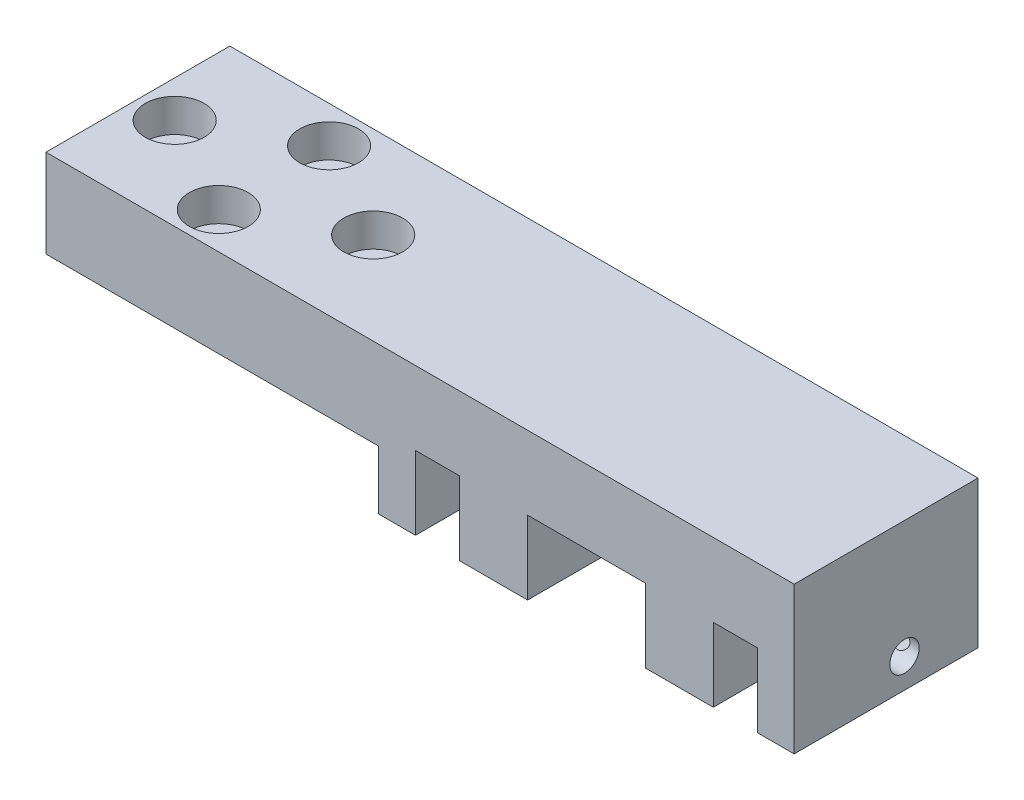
ISO-10303-21;
HEADER;
FILE_DESCRIPTION(('STEP AP214'),'2;1');
FILE_NAME('part.step','',(''),(''),'','','');
FILE_SCHEMA(('AUTOMOTIVE_DESIGN { 1 0 10303 214 1 1 1 1 }'));
ENDSEC;
DATA;
#1=APPLICATION_CONTEXT('core data for automotive mechanical design processes');
#2=APPLICATION_PROTOCOL_DEFINITION('international standard','automotive_design',2000,#1);
#3=PRODUCT_CONTEXT('',#1,'mechanical');
#4=PRODUCT('Part','Part','',(#3));
#5=PRODUCT_RELATED_PRODUCT_CATEGORY('part','',(#4));
#6=PRODUCT_DEFINITION_FORMATION('','',#4);
#7=PRODUCT_DEFINITION_CONTEXT('part definition',#1,'design');
#8=PRODUCT_DEFINITION('design','',#6,#7);
#9=PRODUCT_DEFINITION_SHAPE('','',#8);
#10=(LENGTH_UNIT() NAMED_UNIT(*) SI_UNIT(.MILLI.,.METRE.));
#11=(NAMED_UNIT(*) PLANE_ANGLE_UNIT() SI_UNIT($,.RADIAN.));
#12=(NAMED_UNIT(*) SI_UNIT($,.STERADIAN.) SOLID_ANGLE_UNIT());
#13=UNCERTAINTY_MEASURE_WITH_UNIT(LENGTH_MEASURE(1.E-05),#10,'distance_accuracy_value','');
#14=(GEOMETRIC_REPRESENTATION_CONTEXT(3) GLOBAL_UNCERTAINTY_ASSIGNED_CONTEXT((#13)) GLOBAL_UNIT_ASSIGNED_CONTEXT((#10,
#11,#12)) REPRESENTATION_CONTEXT('',''));
#15=CARTESIAN_POINT('',(0.,0.,0.));
#16=DIRECTION('',(0.,0.,1.));
#17=DIRECTION('',(1.,0.,0.));
#18=AXIS2_PLACEMENT_3D('',#15,#16,#17);
#19=CARTESIAN_POINT('',(31.9999999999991,2.28983498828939E-13,12.5));
#20=DIRECTION('',(0.,1.,0.));
#21=DIRECTION('',(0.,0.,1.));
#22=AXIS2_PLACEMENT_3D('',#19,#20,#21);
#23=CYLINDRICAL_SURFACE('',#22,2.25);
#24=CARTESIAN_POINT('',(31.9999999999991,8.00000000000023,12.5));
#25=DIRECTION('',(0.,1.,0.));
#26=DIRECTION('',(0.,0.,1.));
#27=AXIS2_PLACEMENT_3D('',#24,#25,#26);
#28=CIRCLE('',#27,2.25);
#29=CARTESIAN_POINT('',(31.9999999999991,8.00000000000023,14.75));
#30=VERTEX_POINT('',#29);
#31=EDGE_CURVE('E329',#30,#30,#28,.T.);
#32=ORIENTED_EDGE('',*,*,#31,.F.);
#33=EDGE_LOOP('',(#32));
#34=FACE_BOUND('',#33,.T.);
#35=CARTESIAN_POINT('',(31.9999999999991,15.5000000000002,12.5));
#36=DIRECTION('',(0.,1.,0.));
#37=DIRECTION('',(0.,0.,1.));
#38=AXIS2_PLACEMENT_3D('',#35,#36,#37);
#39=CIRCLE('',#38,2.25);
#40=CARTESIAN_POINT('',(31.9999999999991,15.5000000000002,14.75));
#41=VERTEX_POINT('',#40);
#42=EDGE_CURVE('E36',#41,#41,#39,.F.);
#43=ORIENTED_EDGE('',*,*,#42,.F.);
#44=EDGE_LOOP('',(#43));
#45=FACE_BOUND('',#44,.T.);
#46=ADVANCED_FACE('F32',(#34,#45),#23,.F.);
#47=CARTESIAN_POINT('',(4.99999999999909,2.28983498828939E-13,12.5));
#48=DIRECTION('',(0.,1.,0.));
#49=DIRECTION('',(0.,0.,1.));
#50=AXIS2_PLACEMENT_3D('',#47,#48,#49);
#51=CYLINDRICAL_SURFACE('',#50,2.25);
#52=CARTESIAN_POINT('',(4.99999999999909,8.00000000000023,12.5));
#53=DIRECTION('',(0.,1.,0.));
#54=DIRECTION('',(0.,0.,1.));
#55=AXIS2_PLACEMENT_3D('',#52,#53,#54);
#56=CIRCLE('',#55,2.25);
#57=CARTESIAN_POINT('',(4.99999999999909,8.00000000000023,14.75));
#58=VERTEX_POINT('',#57);
#59=EDGE_CURVE('E326',#58,#58,#56,.T.);
#60=ORIENTED_EDGE('',*,*,#59,.F.);
#61=EDGE_LOOP('',(#60));
#62=FACE_BOUND('',#61,.T.);
#63=CARTESIAN_POINT('',(4.99999999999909,15.5000000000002,12.5));
#64=DIRECTION('',(0.,1.,0.));
#65=DIRECTION('',(0.,0.,1.));
#66=AXIS2_PLACEMENT_3D('',#63,#64,#65);
#67=CIRCLE('',#66,2.25);
#68=CARTESIAN_POINT('',(4.99999999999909,15.5000000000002,14.75));
#69=VERTEX_POINT('',#68);
#70=EDGE_CURVE('E340',#69,#69,#67,.F.);
#71=ORIENTED_EDGE('',*,*,#70,.F.);
#72=EDGE_LOOP('',(#71));
#73=FACE_BOUND('',#72,.T.);
#74=ADVANCED_FACE('F444',(#62,#73),#51,.F.);
#75=CARTESIAN_POINT('',(18.4999999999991,2.28983498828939E-13,20.));
#76=DIRECTION('',(0.,1.,0.));
#77=DIRECTION('',(0.,0.,1.));
#78=AXIS2_PLACEMENT_3D('',#75,#76,#77);
#79=CYLINDRICAL_SURFACE('',#78,2.25);
#80=CARTESIAN_POINT('',(18.4999999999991,8.00000000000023,20.));
#81=DIRECTION('',(0.,1.,0.));
#82=DIRECTION('',(0.,0.,1.));
#83=AXIS2_PLACEMENT_3D('',#80,#81,#82);
#84=CIRCLE('',#83,2.25);
#85=CARTESIAN_POINT('',(18.4999999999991,8.00000000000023,22.25));
#86=VERTEX_POINT('',#85);
#87=EDGE_CURVE('E323',#86,#86,#84,.T.);
#88=ORIENTED_EDGE('',*,*,#87,.F.);
#89=EDGE_LOOP('',(#88));
#90=FACE_BOUND('',#89,.T.);
#91=CARTESIAN_POINT('',(18.4999999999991,15.5000000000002,20.));
#92=DIRECTION('',(0.,1.,0.));
#93=DIRECTION('',(0.,0.,1.));
#94=AXIS2_PLACEMENT_3D('',#91,#92,#93);
#95=CIRCLE('',#94,2.25);
#96=CARTESIAN_POINT('',(18.4999999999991,15.5000000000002,22.25));
#97=VERTEX_POINT('',#96);
#98=EDGE_CURVE('E336',#97,#97,#95,.F.);
#99=ORIENTED_EDGE('',*,*,#98,.F.);
#100=EDGE_LOOP('',(#99));
#101=FACE_BOUND('',#100,.T.);
#102=ADVANCED_FACE('F450',(#90,#101),#79,.F.);
#103=CARTESIAN_POINT('',(18.4999999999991,2.28983498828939E-13,5.));
#104=DIRECTION('',(0.,1.,0.));
#105=DIRECTION('',(0.,0.,1.));
#106=AXIS2_PLACEMENT_3D('',#103,#104,#105);
#107=CYLINDRICAL_SURFACE('',#106,2.25);
#108=CARTESIAN_POINT('',(18.4999999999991,8.00000000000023,5.));
#109=DIRECTION('',(0.,1.,0.));
#110=DIRECTION('',(0.,0.,1.));
#111=AXIS2_PLACEMENT_3D('',#108,#109,#110);
#112=CIRCLE('',#111,2.25);
#113=CARTESIAN_POINT('',(18.4999999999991,8.00000000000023,7.25));
#114=VERTEX_POINT('',#113);
#115=EDGE_CURVE('E320',#114,#114,#112,.T.);
#116=ORIENTED_EDGE('',*,*,#115,.F.);
#117=EDGE_LOOP('',(#116));
#118=FACE_BOUND('',#117,.T.);
#119=CARTESIAN_POINT('',(18.4999999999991,15.5000000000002,5.));
#120=DIRECTION('',(0.,1.,0.));
#121=DIRECTION('',(0.,0.,1.));
#122=AXIS2_PLACEMENT_3D('',#119,#120,#121);
#123=CIRCLE('',#122,2.25);
#124=CARTESIAN_POINT('',(18.4999999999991,15.5000000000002,7.25));
#125=VERTEX_POINT('',#124);
#126=EDGE_CURVE('E332',#125,#125,#123,.F.);
#127=ORIENTED_EDGE('',*,*,#126,.F.);
#128=EDGE_LOOP('',(#127));
#129=FACE_BOUND('',#128,.T.);
#130=ADVANCED_FACE('F460',(#118,#129),#107,.F.);
#131=CARTESIAN_POINT('',(81.5000000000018,2.27373675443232E-13,25.));
#132=DIRECTION('',(0.,1.,0.));
#133=DIRECTION('',(0.,0.,1.));
#134=AXIS2_PLACEMENT_3D('',#131,#132,#133);
#135=PLANE('',#134);
#136=DIRECTION('',(1.,0.,0.));
#137=VECTOR('',#136,1.);
#138=CARTESIAN_POINT('',(81.5000000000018,2.27373675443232E-13,0.));
#139=LINE('',#138,#137);
#140=CARTESIAN_POINT('',(81.5000000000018,2.27373675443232E-13,0.));
#141=VERTEX_POINT('',#140);
#142=CARTESIAN_POINT('',(90.7500000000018,2.27373675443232E-13,0.));
#143=VERTEX_POINT('',#142);
#144=EDGE_CURVE('E191',#141,#143,#139,.T.);
#145=ORIENTED_EDGE('',*,*,#144,.T.);
#146=DIRECTION('',(0.,0.,-1.));
#147=VECTOR('',#146,1.);
#148=CARTESIAN_POINT('',(90.7500000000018,2.27373675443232E-13,25.));
#149=LINE('',#148,#147);
#150=CARTESIAN_POINT('',(90.7500000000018,2.27373675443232E-13,25.));
#151=VERTEX_POINT('',#150);
#152=EDGE_CURVE('E11',#151,#143,#149,.T.);
#153=ORIENTED_EDGE('',*,*,#152,.F.);
#154=DIRECTION('',(1.,0.,0.));
#155=VECTOR('',#154,1.);
#156=CARTESIAN_POINT('',(81.5000000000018,2.27373675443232E-13,25.));
#157=LINE('',#156,#155);
#158=CARTESIAN_POINT('',(81.5000000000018,2.27373675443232E-13,25.));
#159=VERTEX_POINT('',#158);
#160=EDGE_CURVE('E226',#159,#151,#157,.T.);
#161=ORIENTED_EDGE('',*,*,#160,.F.);
#162=DIRECTION('',(0.,0.,-1.));
#163=VECTOR('',#162,1.);
#164=CARTESIAN_POINT('',(81.5000000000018,2.27373675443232E-13,25.));
#165=LINE('',#164,#163);
#166=EDGE_CURVE('E187',#159,#141,#165,.T.);
#167=ORIENTED_EDGE('',*,*,#166,.T.);
#168=EDGE_LOOP('',(#145,#153,#161,#167));
#169=FACE_BOUND('',#168,.T.);
#170=ADVANCED_FACE('F34',(#169),#135,.F.);
#171=CARTESIAN_POINT('',(90.7500000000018,2.27373675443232E-13,25.));
#172=DIRECTION('',(-1.,0.,0.));
#173=DIRECTION('',(0.,0.,1.));
#174=AXIS2_PLACEMENT_3D('',#171,#172,#173);
#175=PLANE('',#174);
#176=CARTESIAN_POINT('',(90.7500000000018,4.,10.));
#177=DIRECTION('',(-1.,0.,0.));
#178=DIRECTION('',(0.,0.,1.));
#179=AXIS2_PLACEMENT_3D('',#176,#177,#178);
#180=CIRCLE('',#179,2.);
#181=CARTESIAN_POINT('',(90.7500000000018,4.,12.));
#182=VERTEX_POINT('',#181);
#183=EDGE_CURVE('E195',#182,#182,#180,.T.);
#184=ORIENTED_EDGE('',*,*,#183,.T.);
#185=EDGE_LOOP('',(#184));
#186=FACE_BOUND('',#185,.T.);
#187=DIRECTION('',(0.,1.,0.));
#188=VECTOR('',#187,1.);
#189=CARTESIAN_POINT('',(90.7500000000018,2.27373675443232E-13,0.));
#190=LINE('',#189,#188);
#191=CARTESIAN_POINT('',(90.7500000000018,10.0000000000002,0.));
#192=VERTEX_POINT('',#191);
#193=EDGE_CURVE('E194',#143,#192,#190,.T.);
#194=ORIENTED_EDGE('',*,*,#193,.T.);
#195=DIRECTION('',(0.,0.,-1.));
#196=VECTOR('',#195,1.);
#197=CARTESIAN_POINT('',(90.7500000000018,10.0000000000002,25.));
#198=LINE('',#197,#196);
#199=CARTESIAN_POINT('',(90.7500000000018,10.0000000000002,25.));
#200=VERTEX_POINT('',#199);
#201=EDGE_CURVE('E42',#200,#192,#198,.T.);
#202=ORIENTED_EDGE('',*,*,#201,.F.);
#203=DIRECTION('',(0.,1.,0.));
#204=VECTOR('',#203,1.);
#205=CARTESIAN_POINT('',(90.7500000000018,2.27373675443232E-13,25.));
#206=LINE('',#205,#204);
#207=EDGE_CURVE('E124',#151,#200,#206,.T.);
#208=ORIENTED_EDGE('',*,*,#207,.F.);
#209=ORIENTED_EDGE('',*,*,#152,.T.);
#210=EDGE_LOOP('',(#194,#202,#208,#209));
#211=FACE_BOUND('',#210,.T.);
#212=ADVANCED_FACE('F467',(#186,#211),#175,.F.);
#213=CARTESIAN_POINT('',(90.7500000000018,10.0000000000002,25.));
#214=DIRECTION('',(0.,1.,0.));
#215=DIRECTION('',(0.,0.,1.));
#216=AXIS2_PLACEMENT_3D('',#213,#214,#215);
#217=PLANE('',#216);
#218=CARTESIAN_POINT('',(93.750000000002,10.0000000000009,20.));
#219=DIRECTION('',(0.,-1.,0.));
#220=DIRECTION('',(1.,0.,0.));
#221=AXIS2_PLACEMENT_3D('',#218,#219,#220);
#222=CIRCLE('',#221,1.75);
#223=CARTESIAN_POINT('',(95.500000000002,10.000000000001,20.));
#224=VERTEX_POINT('',#223);
#225=EDGE_CURVE('E526',#224,#224,#222,.T.);
#226=ORIENTED_EDGE('',*,*,#225,.F.);
#227=EDGE_LOOP('',(#226));
#228=FACE_BOUND('',#227,.T.);
#229=DIRECTION('',(1.,0.,0.));
#230=VECTOR('',#229,1.);
#231=CARTESIAN_POINT('',(90.7500000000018,10.0000000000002,0.));
#232=LINE('',#231,#230);
#233=CARTESIAN_POINT('',(96.7500000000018,10.0000000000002,0.));
#234=VERTEX_POINT('',#233);
#235=EDGE_CURVE('E197',#192,#234,#232,.T.);
#236=ORIENTED_EDGE('',*,*,#235,.T.);
#237=DIRECTION('',(0.,0.,-1.));
#238=VECTOR('',#237,1.);
#239=CARTESIAN_POINT('',(96.7500000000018,10.0000000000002,25.));
#240=LINE('',#239,#238);
#241=CARTESIAN_POINT('',(96.7500000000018,10.0000000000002,25.));
#242=VERTEX_POINT('',#241);
#243=EDGE_CURVE('E263',#242,#234,#240,.T.);
#244=ORIENTED_EDGE('',*,*,#243,.F.);
#245=DIRECTION('',(1.,0.,0.));
#246=VECTOR('',#245,1.);
#247=CARTESIAN_POINT('',(90.7500000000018,10.0000000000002,25.));
#248=LINE('',#247,#246);
#249=EDGE_CURVE('E393',#200,#242,#248,.T.);
#250=ORIENTED_EDGE('',*,*,#249,.F.);
#251=ORIENTED_EDGE('',*,*,#201,.T.);
#252=EDGE_LOOP('',(#236,#244,#250,#251));
#253=FACE_BOUND('',#252,.T.);
#254=ADVANCED_FACE('F592',(#228,#253),#217,.F.);
#255=CARTESIAN_POINT('',(96.7500000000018,2.27373675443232E-13,25.));
#256=DIRECTION('',(1.,0.,0.));
#257=DIRECTION('',(0.,0.,-1.));
#258=AXIS2_PLACEMENT_3D('',#255,#256,#257);
#259=PLANE('',#258);
#260=CARTESIAN_POINT('',(96.7500000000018,4.,10.));
#261=DIRECTION('',(1.,0.,0.));
#262=DIRECTION('',(0.,0.,-1.));
#263=AXIS2_PLACEMENT_3D('',#260,#261,#262);
#264=CIRCLE('',#263,2.);
#265=CARTESIAN_POINT('',(96.7500000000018,4.,8.));
#266=VERTEX_POINT('',#265);
#267=EDGE_CURVE('E386',#266,#266,#264,.T.);
#268=ORIENTED_EDGE('',*,*,#267,.T.);
#269=EDGE_LOOP('',(#268));
#270=FACE_BOUND('',#269,.T.);
#271=DIRECTION('',(0.,-1.,0.));
#272=VECTOR('',#271,1.);
#273=CARTESIAN_POINT('',(96.7500000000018,2.27373675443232E-13,0.));
#274=LINE('',#273,#272);
#275=CARTESIAN_POINT('',(96.7500000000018,2.27373675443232E-13,0.));
#276=VERTEX_POINT('',#275);
#277=EDGE_CURVE('E199',#234,#276,#274,.T.);
#278=ORIENTED_EDGE('',*,*,#277,.T.);
#279=DIRECTION('',(0.,0.,-1.));
#280=VECTOR('',#279,1.);
#281=CARTESIAN_POINT('',(96.7500000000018,2.27373675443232E-13,25.));
#282=LINE('',#281,#280);
#283=CARTESIAN_POINT('',(96.7500000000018,2.27373675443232E-13,25.));
#284=VERTEX_POINT('',#283);
#285=EDGE_CURVE('E260',#284,#276,#282,.T.);
#286=ORIENTED_EDGE('',*,*,#285,.F.);
#287=DIRECTION('',(0.,-1.,0.));
#288=VECTOR('',#287,1.);
#289=CARTESIAN_POINT('',(96.7500000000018,2.27373675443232E-13,25.));
#290=LINE('',#289,#288);
#291=EDGE_CURVE('E395',#242,#284,#290,.T.);
#292=ORIENTED_EDGE('',*,*,#291,.F.);
#293=ORIENTED_EDGE('',*,*,#243,.T.);
#294=EDGE_LOOP('',(#278,#286,#292,#293));
#295=FACE_BOUND('',#294,.T.);
#296=ADVANCED_FACE('F588',(#270,#295),#259,.F.);
#297=CARTESIAN_POINT('',(96.7500000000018,2.27373675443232E-13,25.));
#298=DIRECTION('',(0.,1.,0.));
#299=DIRECTION('',(0.,0.,1.));
#300=AXIS2_PLACEMENT_3D('',#297,#298,#299);
#301=PLANE('',#300);
#302=DIRECTION('',(1.,0.,0.));
#303=VECTOR('',#302,1.);
#304=CARTESIAN_POINT('',(96.7500000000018,2.27373675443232E-13,0.));
#305=LINE('',#304,#303);
#306=CARTESIAN_POINT('',(101.750000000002,2.27373675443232E-13,0.));
#307=VERTEX_POINT('',#306);
#308=EDGE_CURVE('E201',#276,#307,#305,.T.);
#309=ORIENTED_EDGE('',*,*,#308,.T.);
#310=DIRECTION('',(0.,0.,-1.));
#311=VECTOR('',#310,1.);
#312=CARTESIAN_POINT('',(101.750000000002,2.27373675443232E-13,25.));
#313=LINE('',#312,#311);
#314=CARTESIAN_POINT('',(101.750000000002,2.27373675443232E-13,25.));
#315=VERTEX_POINT('',#314);
#316=EDGE_CURVE('E257',#315,#307,#313,.T.);
#317=ORIENTED_EDGE('',*,*,#316,.F.);
#318=DIRECTION('',(1.,0.,0.));
#319=VECTOR('',#318,1.);
#320=CARTESIAN_POINT('',(96.7500000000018,2.27373675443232E-13,25.));
#321=LINE('',#320,#319);
#322=EDGE_CURVE('E397',#284,#315,#321,.T.);
#323=ORIENTED_EDGE('',*,*,#322,.F.);
#324=ORIENTED_EDGE('',*,*,#285,.T.);
#325=EDGE_LOOP('',(#309,#317,#323,#324));
#326=FACE_BOUND('',#325,.T.);
#327=ADVANCED_FACE('F584',(#326),#301,.F.);
#328=CARTESIAN_POINT('',(101.750000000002,2.27373675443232E-13,25.));
#329=DIRECTION('',(-1.,0.,0.));
#330=DIRECTION('',(0.,0.,1.));
#331=AXIS2_PLACEMENT_3D('',#328,#329,#330);
#332=PLANE('',#331);
#333=CARTESIAN_POINT('',(101.750000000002,4.,10.));
#334=DIRECTION('',(1.,0.,0.));
#335=DIRECTION('',(0.,0.,-1.));
#336=AXIS2_PLACEMENT_3D('',#333,#334,#335);
#337=CIRCLE('',#336,2.);
#338=CARTESIAN_POINT('',(101.750000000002,4.,8.));
#339=VERTEX_POINT('',#338);
#340=EDGE_CURVE('E272',#339,#339,#337,.T.);
#341=ORIENTED_EDGE('',*,*,#340,.F.);
#342=EDGE_LOOP('',(#341));
#343=FACE_BOUND('',#342,.T.);
#344=DIRECTION('',(0.,1.,0.));
#345=VECTOR('',#344,1.);
#346=CARTESIAN_POINT('',(101.750000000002,2.27373675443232E-13,0.));
#347=LINE('',#346,#345);
#348=CARTESIAN_POINT('',(101.750000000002,20.0000000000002,0.));
#349=VERTEX_POINT('',#348);
#350=EDGE_CURVE('E203',#307,#349,#347,.T.);
#351=ORIENTED_EDGE('',*,*,#350,.T.);
#352=DIRECTION('',(0.,0.,-1.));
#353=VECTOR('',#352,1.);
#354=CARTESIAN_POINT('',(101.750000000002,20.0000000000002,25.));
#355=LINE('',#354,#353);
#356=CARTESIAN_POINT('',(101.750000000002,20.0000000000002,25.));
#357=VERTEX_POINT('',#356);
#358=EDGE_CURVE('E254',#357,#349,#355,.T.);
#359=ORIENTED_EDGE('',*,*,#358,.F.);
#360=DIRECTION('',(0.,1.,0.));
#361=VECTOR('',#360,1.);
#362=CARTESIAN_POINT('',(101.750000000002,2.27373675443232E-13,25.));
#363=LINE('',#362,#361);
#364=EDGE_CURVE('E399',#315,#357,#363,.T.);
#365=ORIENTED_EDGE('',*,*,#364,.F.);
#366=ORIENTED_EDGE('',*,*,#316,.T.);
#367=EDGE_LOOP('',(#351,#359,#365,#366));
#368=FACE_BOUND('',#367,.T.);
#369=ADVANCED_FACE('F547',(#343,#368),#332,.F.);
#370=CARTESIAN_POINT('',(-9.09494701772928E-13,20.0000000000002,25.));
#371=DIRECTION('',(0.,-1.,0.));
#372=DIRECTION('',(0.,0.,-1.));
#373=AXIS2_PLACEMENT_3D('',#370,#371,#372);
#374=PLANE('',#373);
#375=CARTESIAN_POINT('',(31.9999999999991,20.0000000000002,12.5));
#376=DIRECTION('',(0.,1.,0.));
#377=DIRECTION('',(0.,0.,1.));
#378=AXIS2_PLACEMENT_3D('',#375,#376,#377);
#379=CIRCLE('',#378,4.);
#380=CARTESIAN_POINT('',(31.9999999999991,20.0000000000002,16.5));
#381=VERTEX_POINT('',#380);
#382=EDGE_CURVE('E356',#381,#381,#379,.T.);
#383=ORIENTED_EDGE('',*,*,#382,.F.);
#384=EDGE_LOOP('',(#383));
#385=FACE_BOUND('',#384,.T.);
#386=CARTESIAN_POINT('',(4.99999999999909,20.0000000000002,12.5));
#387=DIRECTION('',(0.,1.,0.));
#388=DIRECTION('',(0.,0.,1.));
#389=AXIS2_PLACEMENT_3D('',#386,#387,#388);
#390=CIRCLE('',#389,4.);
#391=CARTESIAN_POINT('',(4.99999999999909,20.0000000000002,16.5));
#392=VERTEX_POINT('',#391);
#393=EDGE_CURVE('E349',#392,#392,#390,.T.);
#394=ORIENTED_EDGE('',*,*,#393,.F.);
#395=EDGE_LOOP('',(#394));
#396=FACE_BOUND('',#395,.T.);
#397=CARTESIAN_POINT('',(18.4999999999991,20.0000000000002,20.));
#398=DIRECTION('',(0.,1.,0.));
#399=DIRECTION('',(0.,0.,1.));
#400=AXIS2_PLACEMENT_3D('',#397,#398,#399);
#401=CIRCLE('',#400,4.);
#402=CARTESIAN_POINT('',(18.4999999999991,20.0000000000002,24.));
#403=VERTEX_POINT('',#402);
#404=EDGE_CURVE('E342',#403,#403,#401,.T.);
#405=ORIENTED_EDGE('',*,*,#404,.F.);
#406=EDGE_LOOP('',(#405));
#407=FACE_BOUND('',#406,.T.);
#408=CARTESIAN_POINT('',(18.4999999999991,20.0000000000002,5.));
#409=DIRECTION('',(0.,1.,0.));
#410=DIRECTION('',(0.,0.,1.));
#411=AXIS2_PLACEMENT_3D('',#408,#409,#410);
#412=CIRCLE('',#411,4.);
#413=CARTESIAN_POINT('',(18.4999999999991,20.0000000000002,9.));
#414=VERTEX_POINT('',#413);
#415=EDGE_CURVE('E338',#414,#414,#412,.T.);
#416=ORIENTED_EDGE('',*,*,#415,.F.);
#417=EDGE_LOOP('',(#416));
#418=FACE_BOUND('',#417,.T.);
#419=DIRECTION('',(-1.,0.,0.));
#420=VECTOR('',#419,1.);
#421=CARTESIAN_POINT('',(-9.09494701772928E-13,20.0000000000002,0.));
#422=LINE('',#421,#420);
#423=CARTESIAN_POINT('',(-9.09494701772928E-13,20.0000000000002,0.));
#424=VERTEX_POINT('',#423);
#425=EDGE_CURVE('E205',#349,#424,#422,.T.);
#426=ORIENTED_EDGE('',*,*,#425,.T.);
#427=DIRECTION('',(0.,0.,-1.));
#428=VECTOR('',#427,1.);
#429=CARTESIAN_POINT('',(-9.09494701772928E-13,20.0000000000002,25.));
#430=LINE('',#429,#428);
#431=CARTESIAN_POINT('',(-9.09494701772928E-13,20.0000000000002,25.));
#432=VERTEX_POINT('',#431);
#433=EDGE_CURVE('E251',#432,#424,#430,.T.);
#434=ORIENTED_EDGE('',*,*,#433,.F.);
#435=DIRECTION('',(-1.,0.,0.));
#436=VECTOR('',#435,1.);
#437=CARTESIAN_POINT('',(-9.09494701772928E-13,20.0000000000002,25.));
#438=LINE('',#437,#436);
#439=EDGE_CURVE('E401',#357,#432,#438,.T.);
#440=ORIENTED_EDGE('',*,*,#439,.F.);
#441=ORIENTED_EDGE('',*,*,#358,.T.);
#442=EDGE_LOOP('',(#426,#434,#440,#441));
#443=FACE_BOUND('',#442,.T.);
#444=ADVANCED_FACE('F543',(#385,#396,#407,#418,#443),#374,.F.);
#445=CARTESIAN_POINT('',(-9.09494701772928E-13,20.0000000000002,25.));
#446=DIRECTION('',(1.,0.,0.));
#447=DIRECTION('',(0.,0.,-1.));
#448=AXIS2_PLACEMENT_3D('',#445,#446,#447);
#449=PLANE('',#448);
#450=DIRECTION('',(0.,-1.,0.));
#451=VECTOR('',#450,1.);
#452=CARTESIAN_POINT('',(-9.09494701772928E-13,20.0000000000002,0.));
#453=LINE('',#452,#451);
#454=CARTESIAN_POINT('',(-9.09494701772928E-13,8.00000000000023,0.));
#455=VERTEX_POINT('',#454);
#456=EDGE_CURVE('E207',#424,#455,#453,.T.);
#457=ORIENTED_EDGE('',*,*,#456,.T.);
#458=DIRECTION('',(0.,0.,-1.));
#459=VECTOR('',#458,1.);
#460=CARTESIAN_POINT('',(-9.09494701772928E-13,8.00000000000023,25.));
#461=LINE('',#460,#459);
#462=CARTESIAN_POINT('',(-9.09494701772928E-13,8.00000000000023,25.));
#463=VERTEX_POINT('',#462);
#464=EDGE_CURVE('E248',#463,#455,#461,.T.);
#465=ORIENTED_EDGE('',*,*,#464,.F.);
#466=DIRECTION('',(0.,-1.,0.));
#467=VECTOR('',#466,1.);
#468=CARTESIAN_POINT('',(-9.09494701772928E-13,20.0000000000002,25.));
#469=LINE('',#468,#467);
#470=EDGE_CURVE('E403',#432,#463,#469,.T.);
#471=ORIENTED_EDGE('',*,*,#470,.F.);
#472=ORIENTED_EDGE('',*,*,#433,.T.);
#473=EDGE_LOOP('',(#457,#465,#471,#472));
#474=FACE_BOUND('',#473,.T.);
#475=ADVANCED_FACE('F546',(#474),#449,.F.);
#476=CARTESIAN_POINT('',(-9.09494701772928E-13,8.00000000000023,25.));
#477=DIRECTION('',(0.,1.,0.));
#478=DIRECTION('',(0.,0.,1.));
#479=AXIS2_PLACEMENT_3D('',#476,#477,#478);
#480=PLANE('',#479);
#481=ORIENTED_EDGE('',*,*,#31,.T.);
#482=EDGE_LOOP('',(#481));
#483=FACE_BOUND('',#482,.T.);
#484=ORIENTED_EDGE('',*,*,#59,.T.);
#485=EDGE_LOOP('',(#484));
#486=FACE_BOUND('',#485,.T.);
#487=ORIENTED_EDGE('',*,*,#87,.T.);
#488=EDGE_LOOP('',(#487));
#489=FACE_BOUND('',#488,.T.);
#490=ORIENTED_EDGE('',*,*,#115,.T.);
#491=EDGE_LOOP('',(#490));
#492=FACE_BOUND('',#491,.T.);
#493=DIRECTION('',(1.,0.,0.));
#494=VECTOR('',#493,1.);
#495=CARTESIAN_POINT('',(-9.09494701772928E-13,8.00000000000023,0.));
#496=LINE('',#495,#494);
#497=CARTESIAN_POINT('',(45.2500000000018,8.00000000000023,0.));
#498=VERTEX_POINT('',#497);
#499=EDGE_CURVE('E209',#455,#498,#496,.T.);
#500=ORIENTED_EDGE('',*,*,#499,.T.);
#501=DIRECTION('',(0.,0.,-1.));
#502=VECTOR('',#501,1.);
#503=CARTESIAN_POINT('',(45.2500000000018,8.00000000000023,25.));
#504=LINE('',#503,#502);
#505=CARTESIAN_POINT('',(45.2500000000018,8.00000000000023,25.));
#506=VERTEX_POINT('',#505);
#507=EDGE_CURVE('E245',#506,#498,#504,.T.);
#508=ORIENTED_EDGE('',*,*,#507,.F.);
#509=DIRECTION('',(1.,0.,0.));
#510=VECTOR('',#509,1.);
#511=CARTESIAN_POINT('',(-9.09494701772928E-13,8.00000000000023,25.));
#512=LINE('',#511,#510);
#513=EDGE_CURVE('E405',#463,#506,#512,.T.);
#514=ORIENTED_EDGE('',*,*,#513,.F.);
#515=ORIENTED_EDGE('',*,*,#464,.T.);
#516=EDGE_LOOP('',(#500,#508,#514,#515));
#517=FACE_BOUND('',#516,.T.);
#518=ADVANCED_FACE('F569',(#483,#486,#489,#492,#517),#480,.F.);
#519=CARTESIAN_POINT('',(45.2500000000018,2.27373675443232E-13,25.));
#520=DIRECTION('',(1.,0.,0.));
#521=DIRECTION('',(0.,0.,-1.));
#522=AXIS2_PLACEMENT_3D('',#519,#520,#521);
#523=PLANE('',#522);
#524=CARTESIAN_POINT('',(45.2500000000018,4.,10.));
#525=DIRECTION('',(1.,0.,0.));
#526=DIRECTION('',(0.,0.,-1.));
#527=AXIS2_PLACEMENT_3D('',#524,#525,#526);
#528=CIRCLE('',#527,2.);
#529=CARTESIAN_POINT('',(45.2500000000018,4.,8.));
#530=VERTEX_POINT('',#529);
#531=EDGE_CURVE('E383',#530,#530,#528,.T.);
#532=ORIENTED_EDGE('',*,*,#531,.T.);
#533=EDGE_LOOP('',(#532));
#534=FACE_BOUND('',#533,.T.);
#535=DIRECTION('',(0.,-1.,0.));
#536=VECTOR('',#535,1.);
#537=CARTESIAN_POINT('',(45.2500000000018,2.27373675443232E-13,0.));
#538=LINE('',#537,#536);
#539=CARTESIAN_POINT('',(45.2500000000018,2.27373675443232E-13,0.));
#540=VERTEX_POINT('',#539);
#541=EDGE_CURVE('E211',#498,#540,#538,.T.);
#542=ORIENTED_EDGE('',*,*,#541,.T.);
#543=DIRECTION('',(0.,0.,-1.));
#544=VECTOR('',#543,1.);
#545=CARTESIAN_POINT('',(45.2500000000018,2.27373675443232E-13,25.));
#546=LINE('',#545,#544);
#547=CARTESIAN_POINT('',(45.2500000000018,2.27373675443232E-13,25.));
#548=VERTEX_POINT('',#547);
#549=EDGE_CURVE('E242',#548,#540,#546,.T.);
#550=ORIENTED_EDGE('',*,*,#549,.F.);
#551=DIRECTION('',(0.,-1.,0.));
#552=VECTOR('',#551,1.);
#553=CARTESIAN_POINT('',(45.2500000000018,2.27373675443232E-13,25.));
#554=LINE('',#553,#552);
#555=EDGE_CURVE('E407',#506,#548,#554,.T.);
#556=ORIENTED_EDGE('',*,*,#555,.F.);
#557=ORIENTED_EDGE('',*,*,#507,.T.);
#558=EDGE_LOOP('',(#542,#550,#556,#557));
#559=FACE_BOUND('',#558,.T.);
#560=ADVANCED_FACE('F573',(#534,#559),#523,.F.);
#561=CARTESIAN_POINT('',(45.2500000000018,2.27373675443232E-13,25.));
#562=DIRECTION('',(0.,1.,0.));
#563=DIRECTION('',(0.,0.,1.));
#564=AXIS2_PLACEMENT_3D('',#561,#562,#563);
#565=PLANE('',#564);
#566=DIRECTION('',(1.,0.,0.));
#567=VECTOR('',#566,1.);
#568=CARTESIAN_POINT('',(45.2500000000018,2.27373675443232E-13,0.));
#569=LINE('',#568,#567);
#570=CARTESIAN_POINT('',(50.2500000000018,2.27373675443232E-13,0.));
#571=VERTEX_POINT('',#570);
#572=EDGE_CURVE('E213',#540,#571,#569,.T.);
#573=ORIENTED_EDGE('',*,*,#572,.T.);
#574=DIRECTION('',(0.,0.,-1.));
#575=VECTOR('',#574,1.);
#576=CARTESIAN_POINT('',(50.2500000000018,2.27373675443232E-13,25.));
#577=LINE('',#576,#575);
#578=CARTESIAN_POINT('',(50.2500000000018,2.27373675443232E-13,25.));
#579=VERTEX_POINT('',#578);
#580=EDGE_CURVE('E239',#579,#571,#577,.T.);
#581=ORIENTED_EDGE('',*,*,#580,.F.);
#582=DIRECTION('',(1.,0.,0.));
#583=VECTOR('',#582,1.);
#584=CARTESIAN_POINT('',(45.2500000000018,2.27373675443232E-13,25.));
#585=LINE('',#584,#583);
#586=EDGE_CURVE('E409',#548,#579,#585,.T.);
#587=ORIENTED_EDGE('',*,*,#586,.F.);
#588=ORIENTED_EDGE('',*,*,#549,.T.);
#589=EDGE_LOOP('',(#573,#581,#587,#588));
#590=FACE_BOUND('',#589,.T.);
#591=ADVANCED_FACE('F616',(#590),#565,.F.);
#592=CARTESIAN_POINT('',(50.2500000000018,2.27373675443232E-13,25.));
#593=DIRECTION('',(-1.,0.,0.));
#594=DIRECTION('',(0.,0.,1.));
#595=AXIS2_PLACEMENT_3D('',#592,#593,#594);
#596=PLANE('',#595);
#597=CARTESIAN_POINT('',(50.2500000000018,4.,10.));
#598=DIRECTION('',(-1.,0.,0.));
#599=DIRECTION('',(0.,0.,1.));
#600=AXIS2_PLACEMENT_3D('',#597,#598,#599);
#601=CIRCLE('',#600,2.);
#602=CARTESIAN_POINT('',(50.2500000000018,4.,12.));
#603=VERTEX_POINT('',#602);
#604=EDGE_CURVE('E380',#603,#603,#601,.T.);
#605=ORIENTED_EDGE('',*,*,#604,.T.);
#606=EDGE_LOOP('',(#605));
#607=FACE_BOUND('',#606,.T.);
#608=DIRECTION('',(0.,1.,0.));
#609=VECTOR('',#608,1.);
#610=CARTESIAN_POINT('',(50.2500000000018,2.27373675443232E-13,0.));
#611=LINE('',#610,#609);
#612=CARTESIAN_POINT('',(50.2500000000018,10.0000000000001,0.));
#613=VERTEX_POINT('',#612);
#614=EDGE_CURVE('E215',#571,#613,#611,.T.);
#615=ORIENTED_EDGE('',*,*,#614,.T.);
#616=DIRECTION('',(0.,0.,-1.));
#617=VECTOR('',#616,1.);
#618=CARTESIAN_POINT('',(50.2500000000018,10.0000000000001,25.));
#619=LINE('',#618,#617);
#620=CARTESIAN_POINT('',(50.2500000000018,10.0000000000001,25.));
#621=VERTEX_POINT('',#620);
#622=EDGE_CURVE('E236',#621,#613,#619,.T.);
#623=ORIENTED_EDGE('',*,*,#622,.F.);
#624=DIRECTION('',(0.,1.,0.));
#625=VECTOR('',#624,1.);
#626=CARTESIAN_POINT('',(50.2500000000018,2.27373675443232E-13,25.));
#627=LINE('',#626,#625);
#628=EDGE_CURVE('E411',#579,#621,#627,.T.);
#629=ORIENTED_EDGE('',*,*,#628,.F.);
#630=ORIENTED_EDGE('',*,*,#580,.T.);
#631=EDGE_LOOP('',(#615,#623,#629,#630));
#632=FACE_BOUND('',#631,.T.);
#633=ADVANCED_FACE('F620',(#607,#632),#596,.F.);
#634=CARTESIAN_POINT('',(50.2500000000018,10.0000000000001,25.));
#635=DIRECTION('',(0.,1.,0.));
#636=DIRECTION('',(-1.,0.,0.));
#637=AXIS2_PLACEMENT_3D('',#634,#635,#636);
#638=PLANE('',#637);
#639=CARTESIAN_POINT('',(53.250000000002,10.0000000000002,20.));
#640=DIRECTION('',(0.,-1.,0.));
#641=DIRECTION('',(1.,0.,0.));
#642=AXIS2_PLACEMENT_3D('',#639,#640,#641);
#643=CIRCLE('',#642,1.75);
#644=CARTESIAN_POINT('',(55.000000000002,10.0000000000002,20.));
#645=VERTEX_POINT('',#644);
#646=EDGE_CURVE('E525',#645,#645,#643,.T.);
#647=ORIENTED_EDGE('',*,*,#646,.F.);
#648=EDGE_LOOP('',(#647));
#649=FACE_BOUND('',#648,.T.);
#650=DIRECTION('',(1.,0.,0.));
#651=VECTOR('',#650,1.);
#652=CARTESIAN_POINT('',(50.2500000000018,10.0000000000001,0.));
#653=LINE('',#652,#651);
#654=CARTESIAN_POINT('',(56.2500000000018,10.0000000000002,0.));
#655=VERTEX_POINT('',#654);
#656=EDGE_CURVE('E217',#613,#655,#653,.T.);
#657=ORIENTED_EDGE('',*,*,#656,.T.);
#658=DIRECTION('',(0.,0.,-1.));
#659=VECTOR('',#658,1.);
#660=CARTESIAN_POINT('',(56.2500000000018,10.0000000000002,25.));
#661=LINE('',#660,#659);
#662=CARTESIAN_POINT('',(56.2500000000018,10.0000000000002,25.));
#663=VERTEX_POINT('',#662);
#664=EDGE_CURVE('E233',#663,#655,#661,.T.);
#665=ORIENTED_EDGE('',*,*,#664,.F.);
#666=DIRECTION('',(1.,0.,0.));
#667=VECTOR('',#666,1.);
#668=CARTESIAN_POINT('',(50.2500000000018,10.0000000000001,25.));
#669=LINE('',#668,#667);
#670=EDGE_CURVE('E413',#621,#663,#669,.T.);
#671=ORIENTED_EDGE('',*,*,#670,.F.);
#672=ORIENTED_EDGE('',*,*,#622,.T.);
#673=EDGE_LOOP('',(#657,#665,#671,#672));
#674=FACE_BOUND('',#673,.T.);
#675=ADVANCED_FACE('F624',(#649,#674),#638,.F.);
#676=CARTESIAN_POINT('',(56.2500000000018,2.27373675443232E-13,25.));
#677=DIRECTION('',(1.,0.,0.));
#678=DIRECTION('',(0.,0.,-1.));
#679=AXIS2_PLACEMENT_3D('',#676,#677,#678);
#680=PLANE('',#679);
#681=CARTESIAN_POINT('',(56.2500000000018,4.,10.));
#682=DIRECTION('',(1.,0.,0.));
#683=DIRECTION('',(0.,0.,-1.));
#684=AXIS2_PLACEMENT_3D('',#681,#682,#683);
#685=CIRCLE('',#684,2.);
#686=CARTESIAN_POINT('',(56.2500000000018,4.,8.));
#687=VERTEX_POINT('',#686);
#688=EDGE_CURVE('E377',#687,#687,#685,.T.);
#689=ORIENTED_EDGE('',*,*,#688,.T.);
#690=EDGE_LOOP('',(#689));
#691=FACE_BOUND('',#690,.T.);
#692=DIRECTION('',(0.,-1.,0.));
#693=VECTOR('',#692,1.);
#694=CARTESIAN_POINT('',(56.2500000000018,2.27373675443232E-13,0.));
#695=LINE('',#694,#693);
#696=CARTESIAN_POINT('',(56.2500000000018,2.27373675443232E-13,0.));
#697=VERTEX_POINT('',#696);
#698=EDGE_CURVE('E219',#655,#697,#695,.T.);
#699=ORIENTED_EDGE('',*,*,#698,.T.);
#700=DIRECTION('',(0.,0.,-1.));
#701=VECTOR('',#700,1.);
#702=CARTESIAN_POINT('',(56.2500000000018,2.27373675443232E-13,25.));
#703=LINE('',#702,#701);
#704=CARTESIAN_POINT('',(56.2500000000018,2.27373675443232E-13,25.));
#705=VERTEX_POINT('',#704);
#706=EDGE_CURVE('E230',#705,#697,#703,.T.);
#707=ORIENTED_EDGE('',*,*,#706,.F.);
#708=DIRECTION('',(0.,-1.,0.));
#709=VECTOR('',#708,1.);
#710=CARTESIAN_POINT('',(56.2500000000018,2.27373675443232E-13,25.));
#711=LINE('',#710,#709);
#712=EDGE_CURVE('E415',#663,#705,#711,.T.);
#713=ORIENTED_EDGE('',*,*,#712,.F.);
#714=ORIENTED_EDGE('',*,*,#664,.T.);
#715=EDGE_LOOP('',(#699,#707,#713,#714));
#716=FACE_BOUND('',#715,.T.);
#717=ADVANCED_FACE('F421',(#691,#716),#680,.F.);
#718=CARTESIAN_POINT('',(56.2500000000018,2.27373675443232E-13,25.));
#719=DIRECTION('',(0.,1.,0.));
#720=DIRECTION('',(0.,0.,1.));
#721=AXIS2_PLACEMENT_3D('',#718,#719,#720);
#722=PLANE('',#721);
#723=DIRECTION('',(1.,0.,0.));
#724=VECTOR('',#723,1.);
#725=CARTESIAN_POINT('',(56.2500000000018,2.27373675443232E-13,0.));
#726=LINE('',#725,#724);
#727=CARTESIAN_POINT('',(65.5000000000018,2.27373675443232E-13,0.));
#728=VERTEX_POINT('',#727);
#729=EDGE_CURVE('E221',#697,#728,#726,.T.);
#730=ORIENTED_EDGE('',*,*,#729,.T.);
#731=DIRECTION('',(0.,0.,-1.));
#732=VECTOR('',#731,1.);
#733=CARTESIAN_POINT('',(65.5000000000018,2.27373675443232E-13,25.));
#734=LINE('',#733,#732);
#735=CARTESIAN_POINT('',(65.5000000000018,2.27373675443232E-13,25.));
#736=VERTEX_POINT('',#735);
#737=EDGE_CURVE('E182',#736,#728,#734,.T.);
#738=ORIENTED_EDGE('',*,*,#737,.F.);
#739=DIRECTION('',(1.,0.,0.));
#740=VECTOR('',#739,1.);
#741=CARTESIAN_POINT('',(56.2500000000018,2.27373675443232E-13,25.));
#742=LINE('',#741,#740);
#743=EDGE_CURVE('E173',#705,#736,#742,.T.);
#744=ORIENTED_EDGE('',*,*,#743,.F.);
#745=ORIENTED_EDGE('',*,*,#706,.T.);
#746=EDGE_LOOP('',(#730,#738,#744,#745));
#747=FACE_BOUND('',#746,.T.);
#748=ADVANCED_FACE('F425',(#747),#722,.F.);
#749=CARTESIAN_POINT('',(65.5000000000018,2.27373675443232E-13,25.));
#750=DIRECTION('',(-1.,0.,0.));
#751=DIRECTION('',(0.,0.,1.));
#752=AXIS2_PLACEMENT_3D('',#749,#750,#751);
#753=PLANE('',#752);
#754=CARTESIAN_POINT('',(65.5000000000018,4.,10.));
#755=DIRECTION('',(-1.,0.,0.));
#756=DIRECTION('',(0.,0.,1.));
#757=AXIS2_PLACEMENT_3D('',#754,#755,#756);
#758=CIRCLE('',#757,2.);
#759=CARTESIAN_POINT('',(65.5000000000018,4.,12.));
#760=VERTEX_POINT('',#759);
#761=EDGE_CURVE('E271',#760,#760,#758,.T.);
#762=ORIENTED_EDGE('',*,*,#761,.T.);
#763=EDGE_LOOP('',(#762));
#764=FACE_BOUND('',#763,.T.);
#765=DIRECTION('',(0.,1.,0.));
#766=VECTOR('',#765,1.);
#767=CARTESIAN_POINT('',(65.5000000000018,2.27373675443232E-13,0.));
#768=LINE('',#767,#766);
#769=CARTESIAN_POINT('',(65.5000000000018,10.0000000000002,0.));
#770=VERTEX_POINT('',#769);
#771=EDGE_CURVE('E181',#728,#770,#768,.T.);
#772=ORIENTED_EDGE('',*,*,#771,.T.);
#773=DIRECTION('',(0.,0.,-1.));
#774=VECTOR('',#773,1.);
#775=CARTESIAN_POINT('',(65.5000000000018,10.0000000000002,25.));
#776=LINE('',#775,#774);
#777=CARTESIAN_POINT('',(65.5000000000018,10.0000000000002,25.));
#778=VERTEX_POINT('',#777);
#779=EDGE_CURVE('E178',#778,#770,#776,.T.);
#780=ORIENTED_EDGE('',*,*,#779,.F.);
#781=DIRECTION('',(0.,1.,0.));
#782=VECTOR('',#781,1.);
#783=CARTESIAN_POINT('',(65.5000000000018,2.27373675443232E-13,25.));
#784=LINE('',#783,#782);
#785=EDGE_CURVE('E167',#736,#778,#784,.T.);
#786=ORIENTED_EDGE('',*,*,#785,.F.);
#787=ORIENTED_EDGE('',*,*,#737,.T.);
#788=EDGE_LOOP('',(#772,#780,#786,#787));
#789=FACE_BOUND('',#788,.T.);
#790=ADVANCED_FACE('F179',(#764,#789),#753,.F.);
#791=CARTESIAN_POINT('',(81.5000000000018,10.0000000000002,25.));
#792=DIRECTION('',(0.,1.,0.));
#793=DIRECTION('',(0.,0.,1.));
#794=AXIS2_PLACEMENT_3D('',#791,#792,#793);
#795=PLANE('',#794);
#796=DIRECTION('',(1.,0.,0.));
#797=VECTOR('',#796,1.);
#798=CARTESIAN_POINT('',(81.5000000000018,10.0000000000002,0.));
#799=LINE('',#798,#797);
#800=CARTESIAN_POINT('',(81.5000000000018,10.0000000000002,0.));
#801=VERTEX_POINT('',#800);
#802=EDGE_CURVE('E110',#770,#801,#799,.T.);
#803=ORIENTED_EDGE('',*,*,#802,.T.);
#804=DIRECTION('',(0.,0.,-1.));
#805=VECTOR('',#804,1.);
#806=CARTESIAN_POINT('',(81.5000000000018,10.0000000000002,25.));
#807=LINE('',#806,#805);
#808=CARTESIAN_POINT('',(81.5000000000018,10.0000000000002,25.));
#809=VERTEX_POINT('',#808);
#810=EDGE_CURVE('E183',#809,#801,#807,.T.);
#811=ORIENTED_EDGE('',*,*,#810,.F.);
#812=DIRECTION('',(1.,0.,0.));
#813=VECTOR('',#812,1.);
#814=CARTESIAN_POINT('',(81.5000000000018,10.0000000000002,25.));
#815=LINE('',#814,#813);
#816=EDGE_CURVE('E171',#778,#809,#815,.T.);
#817=ORIENTED_EDGE('',*,*,#816,.F.);
#818=ORIENTED_EDGE('',*,*,#779,.T.);
#819=EDGE_LOOP('',(#803,#811,#817,#818));
#820=FACE_BOUND('',#819,.T.);
#821=ADVANCED_FACE('F185',(#820),#795,.F.);
#822=CARTESIAN_POINT('',(81.5000000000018,2.27373675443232E-13,25.));
#823=DIRECTION('',(1.,0.,0.));
#824=DIRECTION('',(0.,0.,-1.));
#825=AXIS2_PLACEMENT_3D('',#822,#823,#824);
#826=PLANE('',#825);
#827=CARTESIAN_POINT('',(81.5000000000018,4.,10.));
#828=DIRECTION('',(1.,0.,0.));
#829=DIRECTION('',(0.,0.,-1.));
#830=AXIS2_PLACEMENT_3D('',#827,#828,#829);
#831=CIRCLE('',#830,2.);
#832=CARTESIAN_POINT('',(81.5000000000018,4.,8.));
#833=VERTEX_POINT('',#832);
#834=EDGE_CURVE('E268',#833,#833,#831,.T.);
#835=ORIENTED_EDGE('',*,*,#834,.T.);
#836=EDGE_LOOP('',(#835));
#837=FACE_BOUND('',#836,.T.);
#838=DIRECTION('',(0.,-1.,0.));
#839=VECTOR('',#838,1.);
#840=CARTESIAN_POINT('',(81.5000000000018,2.27373675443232E-13,0.));
#841=LINE('',#840,#839);
#842=EDGE_CURVE('E116',#801,#141,#841,.T.);
#843=ORIENTED_EDGE('',*,*,#842,.T.);
#844=ORIENTED_EDGE('',*,*,#166,.F.);
#845=DIRECTION('',(0.,-1.,0.));
#846=VECTOR('',#845,1.);
#847=CARTESIAN_POINT('',(81.5000000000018,2.27373675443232E-13,25.));
#848=LINE('',#847,#846);
#849=EDGE_CURVE('E51',#809,#159,#848,.T.);
#850=ORIENTED_EDGE('',*,*,#849,.F.);
#851=ORIENTED_EDGE('',*,*,#810,.T.);
#852=EDGE_LOOP('',(#843,#844,#850,#851));
#853=FACE_BOUND('',#852,.T.);
#854=ADVANCED_FACE('F433',(#837,#853),#826,.F.);
#855=CARTESIAN_POINT('',(90.7500000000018,2.27373675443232E-13,25.));
#856=DIRECTION('',(0.,0.,1.));
#857=DIRECTION('',(1.,0.,0.));
#858=AXIS2_PLACEMENT_3D('',#855,#856,#857);
#859=PLANE('',#858);
#860=ORIENTED_EDGE('',*,*,#160,.T.);
#861=ORIENTED_EDGE('',*,*,#207,.T.);
#862=ORIENTED_EDGE('',*,*,#249,.T.);
#863=ORIENTED_EDGE('',*,*,#291,.T.);
#864=ORIENTED_EDGE('',*,*,#322,.T.);
#865=ORIENTED_EDGE('',*,*,#364,.T.);
#866=ORIENTED_EDGE('',*,*,#439,.T.);
#867=ORIENTED_EDGE('',*,*,#470,.T.);
#868=ORIENTED_EDGE('',*,*,#513,.T.);
#869=ORIENTED_EDGE('',*,*,#555,.T.);
#870=ORIENTED_EDGE('',*,*,#586,.T.);
#871=ORIENTED_EDGE('',*,*,#628,.T.);
#872=ORIENTED_EDGE('',*,*,#670,.T.);
#873=ORIENTED_EDGE('',*,*,#712,.T.);
#874=ORIENTED_EDGE('',*,*,#743,.T.);
#875=ORIENTED_EDGE('',*,*,#785,.T.);
#876=ORIENTED_EDGE('',*,*,#816,.T.);
#877=ORIENTED_EDGE('',*,*,#849,.T.);
#878=EDGE_LOOP('',(#860,#861,#862,#863,#864,#865,#866,#867,#868,#869,#870,#871,#872,#873,#874,
#875,#876,#877));
#879=FACE_BOUND('',#878,.T.);
#880=ADVANCED_FACE('F169',(#879),#859,.T.);
#881=CARTESIAN_POINT('',(90.7500000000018,2.27373675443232E-13,0.));
#882=DIRECTION('',(0.,0.,1.));
#883=DIRECTION('',(1.,0.,0.));
#884=AXIS2_PLACEMENT_3D('',#881,#882,#883);
#885=PLANE('',#884);
#886=CARTESIAN_POINT('',(47.7500000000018,4.,0.));
#887=DIRECTION('',(0.,0.,-1.));
#888=DIRECTION('',(-1.,0.,0.));
#889=AXIS2_PLACEMENT_3D('',#886,#887,#888);
#890=CIRCLE('',#889,1.25);
#891=CARTESIAN_POINT('',(46.5000000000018,4.,0.));
#892=VERTEX_POINT('',#891);
#893=EDGE_CURVE('E319',#892,#892,#890,.T.);
#894=ORIENTED_EDGE('',*,*,#893,.F.);
#895=EDGE_LOOP('',(#894));
#896=FACE_BOUND('',#895,.T.);
#897=CARTESIAN_POINT('',(61.2500000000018,4.,0.));
#898=DIRECTION('',(0.,0.,-1.));
#899=DIRECTION('',(-1.,0.,0.));
#900=AXIS2_PLACEMENT_3D('',#897,#898,#899);
#901=CIRCLE('',#900,1.25);
#902=CARTESIAN_POINT('',(60.0000000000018,4.,0.));
#903=VERTEX_POINT('',#902);
#904=EDGE_CURVE('E313',#903,#903,#901,.T.);
#905=ORIENTED_EDGE('',*,*,#904,.F.);
#906=EDGE_LOOP('',(#905));
#907=FACE_BOUND('',#906,.T.);
#908=CARTESIAN_POINT('',(85.7500000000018,4.,0.));
#909=DIRECTION('',(0.,0.,-1.));
#910=DIRECTION('',(-1.,0.,0.));
#911=AXIS2_PLACEMENT_3D('',#908,#909,#910);
#912=CIRCLE('',#911,1.25);
#913=CARTESIAN_POINT('',(84.5000000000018,4.,0.));
#914=VERTEX_POINT('',#913);
#915=EDGE_CURVE('E312',#914,#914,#912,.T.);
#916=ORIENTED_EDGE('',*,*,#915,.F.);
#917=EDGE_LOOP('',(#916));
#918=FACE_BOUND('',#917,.T.);
#919=CARTESIAN_POINT('',(99.2500000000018,4.,0.));
#920=DIRECTION('',(0.,0.,-1.));
#921=DIRECTION('',(-1.,0.,0.));
#922=AXIS2_PLACEMENT_3D('',#919,#920,#921);
#923=CIRCLE('',#922,1.25);
#924=CARTESIAN_POINT('',(98.0000000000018,4.,0.));
#925=VERTEX_POINT('',#924);
#926=EDGE_CURVE('E280',#925,#925,#923,.T.);
#927=ORIENTED_EDGE('',*,*,#926,.F.);
#928=EDGE_LOOP('',(#927));
#929=FACE_BOUND('',#928,.T.);
#930=ORIENTED_EDGE('',*,*,#144,.F.);
#931=ORIENTED_EDGE('',*,*,#842,.F.);
#932=ORIENTED_EDGE('',*,*,#802,.F.);
#933=ORIENTED_EDGE('',*,*,#771,.F.);
#934=ORIENTED_EDGE('',*,*,#729,.F.);
#935=ORIENTED_EDGE('',*,*,#698,.F.);
#936=ORIENTED_EDGE('',*,*,#656,.F.);
#937=ORIENTED_EDGE('',*,*,#614,.F.);
#938=ORIENTED_EDGE('',*,*,#572,.F.);
#939=ORIENTED_EDGE('',*,*,#541,.F.);
#940=ORIENTED_EDGE('',*,*,#499,.F.);
#941=ORIENTED_EDGE('',*,*,#456,.F.);
#942=ORIENTED_EDGE('',*,*,#425,.F.);
#943=ORIENTED_EDGE('',*,*,#350,.F.);
#944=ORIENTED_EDGE('',*,*,#308,.F.);
#945=ORIENTED_EDGE('',*,*,#277,.F.);
#946=ORIENTED_EDGE('',*,*,#235,.F.);
#947=ORIENTED_EDGE('',*,*,#193,.F.);
#948=EDGE_LOOP('',(#930,#931,#932,#933,#934,#935,#936,#937,#938,#939,#940,#941,#942,#943,#944,
#945,#946,#947));
#949=FACE_BOUND('',#948,.T.);
#950=ADVANCED_FACE('F428',(#896,#907,#918,#929,#949),#885,.F.);
#951=CARTESIAN_POINT('',(-9.15933995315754E-13,4.,10.));
#952=DIRECTION('',(1.,0.,0.));
#953=DIRECTION('',(0.,0.,-1.));
#954=AXIS2_PLACEMENT_3D('',#951,#952,#953);
#955=CYLINDRICAL_SURFACE('',#954,2.);
#956=CARTESIAN_POINT('',(84.5000000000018,4.,8.));
#957=CARTESIAN_POINT('',(84.5000043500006,4.0635104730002,8.00000404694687));
#958=CARTESIAN_POINT('',(84.5048730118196,4.12709644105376,8.00305676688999));
#959=CARTESIAN_POINT('',(84.5240858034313,4.25231826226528,8.01497832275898));
#960=CARTESIAN_POINT('',(84.5384479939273,4.31395016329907,8.02385824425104));
#961=CARTESIAN_POINT('',(84.5758113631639,4.43320555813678,8.04654147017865));
#962=CARTESIAN_POINT('',(84.5987697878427,4.49084724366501,8.06032039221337));
#963=CARTESIAN_POINT('',(84.6523858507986,4.60126036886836,8.09165401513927));
#964=CARTESIAN_POINT('',(84.683042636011,4.65403234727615,8.10920829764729));
#965=CARTESIAN_POINT('',(84.7538865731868,4.75797419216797,8.14829847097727));
#966=CARTESIAN_POINT('',(84.7946392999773,4.80867956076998,8.17004037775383));
#967=CARTESIAN_POINT('',(84.8832191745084,4.90298637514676,8.21468650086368));
#968=CARTESIAN_POINT('',(84.9310558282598,4.94657810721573,8.23759225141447));
#969=CARTESIAN_POINT('',(85.0400338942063,5.03142873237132,8.28569581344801));
#970=CARTESIAN_POINT('',(85.1020997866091,5.07157206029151,8.31078389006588));
#971=CARTESIAN_POINT('',(85.233564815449,5.14073966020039,8.35669801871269));
#972=CARTESIAN_POINT('',(85.3029513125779,5.16978270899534,8.37753124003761));
#973=CARTESIAN_POINT('',(85.4288105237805,5.2093340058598,8.40690424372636));
#974=CARTESIAN_POINT('',(85.4839668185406,5.22269552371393,8.41723094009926));
#975=CARTESIAN_POINT('',(85.5963059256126,5.24181843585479,8.43218642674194));
#976=CARTESIAN_POINT('',(85.6534857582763,5.24759056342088,8.43682326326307));
#977=CARTESIAN_POINT('',(85.7684130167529,5.2511891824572,8.43970114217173));
#978=CARTESIAN_POINT('',(85.8261615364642,5.24899483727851,8.43792541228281));
#979=CARTESIAN_POINT('',(85.9403101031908,5.23676317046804,8.4282259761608));
#980=CARTESIAN_POINT('',(85.9967090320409,5.22671956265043,8.42029734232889));
#981=CARTESIAN_POINT('',(86.1054384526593,5.19968103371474,8.39967426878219));
#982=CARTESIAN_POINT('',(86.1578324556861,5.18285016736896,8.38709284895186));
#983=CARTESIAN_POINT('',(86.2591611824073,5.14290189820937,8.35854433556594));
#984=CARTESIAN_POINT('',(86.3080946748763,5.11978227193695,8.34257604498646));
#985=CARTESIAN_POINT('',(86.4108332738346,5.06294892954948,8.3054518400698));
#986=CARTESIAN_POINT('',(86.4638408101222,5.02806296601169,8.2838840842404));
#987=CARTESIAN_POINT('',(86.5638302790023,4.95088146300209,8.23994288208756));
#988=CARTESIAN_POINT('',(86.6108059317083,4.90857830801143,8.21756862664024));
#989=CARTESIAN_POINT('',(86.7053017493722,4.80951971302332,8.17020105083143));
#990=CARTESIAN_POINT('',(86.7516329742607,4.75153135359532,8.14538468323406));
#991=CARTESIAN_POINT('',(86.8338508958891,4.62714809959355,8.09971944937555));
#992=CARTESIAN_POINT('',(86.8697416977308,4.56075652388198,8.07886902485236));
#993=CARTESIAN_POINT('',(86.9277636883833,4.42488356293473,8.04446627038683));
#994=CARTESIAN_POINT('',(86.950534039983,4.35576345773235,8.03058023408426));
#995=CARTESIAN_POINT('',(86.9837649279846,4.21361215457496,8.01015070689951));
#996=CARTESIAN_POINT('',(86.9942428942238,4.14058664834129,8.0035968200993));
#997=CARTESIAN_POINT('',(87.001565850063,4.00451561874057,7.99902159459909));
#998=CARTESIAN_POINT('',(87.0002031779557,3.9415972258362,7.9998783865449));
#999=CARTESIAN_POINT('',(86.9881171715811,3.81702788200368,8.00741098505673));
#1000=CARTESIAN_POINT('',(86.9773944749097,3.75537684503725,8.01408639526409));
#1001=CARTESIAN_POINT('',(86.9477614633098,3.6374789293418,8.0322594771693));
#1002=CARTESIAN_POINT('',(86.9291878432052,3.58111499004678,8.04355829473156));
#1003=CARTESIAN_POINT('',(86.8847036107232,3.472361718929,8.07004315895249));
#1004=CARTESIAN_POINT('',(86.8587917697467,3.41997305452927,8.08522985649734));
#1005=CARTESIAN_POINT('',(86.7974847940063,3.31491594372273,8.12009987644));
#1006=CARTESIAN_POINT('',(86.7613964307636,3.26275303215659,8.14008235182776));
#1007=CARTESIAN_POINT('',(86.682206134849,3.16485735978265,8.18193029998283));
#1008=CARTESIAN_POINT('',(86.6390964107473,3.11913184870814,8.20379785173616));
#1009=CARTESIAN_POINT('',(86.5398649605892,3.02852580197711,8.25094130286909));
#1010=CARTESIAN_POINT('',(86.482762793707,2.98473148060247,8.27625116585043));
#1011=CARTESIAN_POINT('',(86.3611242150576,2.90719648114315,8.32433237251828));
#1012=CARTESIAN_POINT('',(86.2965929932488,2.87344884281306,8.34710546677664));
#1013=CARTESIAN_POINT('',(86.1753078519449,2.82315227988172,8.38266469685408));
#1014=CARTESIAN_POINT('',(86.1197592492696,2.8044810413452,8.39654363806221));
#1015=CARTESIAN_POINT('',(86.0056068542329,2.77499891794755,8.41894969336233));
#1016=CARTESIAN_POINT('',(85.9470079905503,2.76417575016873,8.42748516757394));
#1017=CARTESIAN_POINT('',(85.8279097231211,2.75098616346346,8.43793675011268));
#1018=CARTESIAN_POINT('',(85.7674014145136,2.74866813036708,8.43981498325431));
#1019=CARTESIAN_POINT('',(85.6468690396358,2.75280221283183,8.43650936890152));
#1020=CARTESIAN_POINT('',(85.5868451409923,2.75925724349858,8.43132317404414));
#1021=CARTESIAN_POINT('',(85.4739702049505,2.77961727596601,8.41544611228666));
#1022=CARTESIAN_POINT('',(85.4209306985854,2.79288080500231,8.4052319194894));
#1023=CARTESIAN_POINT('',(85.3178649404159,2.82582376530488,8.38082469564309));
#1024=CARTESIAN_POINT('',(85.2678399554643,2.84550587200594,8.36663000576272));
#1025=CARTESIAN_POINT('',(85.1644032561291,2.89397309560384,8.33336097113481));
#1026=CARTESIAN_POINT('',(85.1115497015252,2.92366355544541,8.31387769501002));
#1027=CARTESIAN_POINT('',(85.0110616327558,2.98999982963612,8.27332293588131));
#1028=CARTESIAN_POINT('',(84.9634313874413,3.02665126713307,8.25225017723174));
#1029=CARTESIAN_POINT('',(84.864985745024,3.11432977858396,8.20598089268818));
#1030=CARTESIAN_POINT('',(84.8154091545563,3.16676632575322,8.18079458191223));
#1031=CARTESIAN_POINT('',(84.7255051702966,3.28017755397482,8.13301270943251));
#1032=CARTESIAN_POINT('',(84.6851835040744,3.34115748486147,8.11041875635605));
#1033=CARTESIAN_POINT('',(84.6152288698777,3.47064460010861,8.07013289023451));
#1034=CARTESIAN_POINT('',(84.585613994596,3.53916427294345,8.05244928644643));
#1035=CARTESIAN_POINT('',(84.5389281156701,3.68160528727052,8.02418478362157));
#1036=CARTESIAN_POINT('',(84.521812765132,3.75550649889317,8.01357878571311));
#1037=CARTESIAN_POINT('',(84.5077007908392,3.85858151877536,8.00480527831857));
#1038=CARTESIAN_POINT('',(84.5048181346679,3.88675139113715,8.00300827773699));
#1039=CARTESIAN_POINT('',(84.5009667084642,3.94327581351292,8.0006046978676));
#1040=CARTESIAN_POINT('',(84.4999980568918,3.97163037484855,7.99999819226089));
#1041=CARTESIAN_POINT('',(84.5000000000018,4.,8.));
#1042=B_SPLINE_CURVE_WITH_KNOTS('',3,(#956,#957,#958,#959,#960,#961,#962,#963,#964,#965,#966,
#967,#968,#969,#970,#971,#972,#973,#974,#975,#976,#977,#978,#979,#980,#981,#982,#983,#984,#985,
#986,#987,#988,#989,#990,#991,#992,#993,#994,#995,#996,#997,#998,#999,#1000,#1001,#1002,#1003,
#1004,#1005,#1006,#1007,#1008,#1009,#1010,#1011,#1012,#1013,#1014,#1015,#1016,#1017,#1018,#1019,
#1020,#1021,#1022,#1023,#1024,#1025,#1026,#1027,#1028,#1029,#1030,#1031,#1032,#1033,#1034,#1035,
#1036,#1037,#1038,#1039,#1040,#1041),.UNSPECIFIED.,.T.,.F.,(4,2,2,2,2,2,2,2,2,2,2,2,2,2,2,2,2,2,
2,2,2,2,2,2,2,2,2,2,2,2,2,2,2,2,2,2,2,2,2,2,2,2,4),(0.,0.190412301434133,0.381187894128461,
0.571026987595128,0.760845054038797,0.965821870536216,1.17107628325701,1.40412975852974,
1.63678724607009,1.80912008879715,1.98120894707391,2.15374823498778,2.32642584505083,
2.49515839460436,2.66395067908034,2.86427450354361,3.06480522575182,3.29842180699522,
3.53194640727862,3.7528417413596,3.97342347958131,4.16127180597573,4.34910733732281,
4.52959504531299,4.71011298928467,4.90885230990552,5.10781368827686,5.33565708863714,
5.56334227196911,5.74329940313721,5.92297427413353,6.10366974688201,6.28442527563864,
6.4506316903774,6.61690747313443,6.80725523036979,6.9977574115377,7.22600539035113,
7.45439424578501,7.68316725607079,7.91112460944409,7.9961750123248,8.08123067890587),.UNSPECIFIED.);
#1043=CARTESIAN_POINT('',(84.5000000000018,4.,8.));
#1044=VERTEX_POINT('',#1043);
#1045=EDGE_CURVE('E281',#1044,#1044,#1042,.T.);
#1046=ORIENTED_EDGE('',*,*,#1045,.T.);
#1047=EDGE_LOOP('',(#1046));
#1048=FACE_BOUND('',#1047,.T.);
#1049=ORIENTED_EDGE('',*,*,#834,.F.);
#1050=EDGE_LOOP('',(#1049));
#1051=FACE_BOUND('',#1050,.T.);
#1052=ORIENTED_EDGE('',*,*,#183,.F.);
#1053=EDGE_LOOP('',(#1052));
#1054=FACE_BOUND('',#1053,.T.);
#1055=ADVANCED_FACE('F286',(#1048,#1051,#1054),#955,.F.);
#1056=CARTESIAN_POINT('',(60.0000000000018,4.,8.));
#1057=CARTESIAN_POINT('',(60.0000043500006,4.0635104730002,8.00000404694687));
#1058=CARTESIAN_POINT('',(60.0048730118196,4.12709644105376,8.00305676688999));
#1059=CARTESIAN_POINT('',(60.0240858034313,4.25231826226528,8.01497832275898));
#1060=CARTESIAN_POINT('',(60.0384479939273,4.31395016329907,8.02385824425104));
#1061=CARTESIAN_POINT('',(60.0758113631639,4.43320555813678,8.04654147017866));
#1062=CARTESIAN_POINT('',(60.0987697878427,4.49084724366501,8.06032039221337));
#1063=CARTESIAN_POINT('',(60.1523858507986,4.60126036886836,8.09165401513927));
#1064=CARTESIAN_POINT('',(60.183042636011,4.65403234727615,8.10920829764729));
#1065=CARTESIAN_POINT('',(60.2538865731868,4.75797419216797,8.14829847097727));
#1066=CARTESIAN_POINT('',(60.2946392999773,4.80867956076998,8.17004037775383));
#1067=CARTESIAN_POINT('',(60.3832191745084,4.90298637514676,8.21468650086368));
#1068=CARTESIAN_POINT('',(60.4310558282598,4.94657810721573,8.23759225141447));
#1069=CARTESIAN_POINT('',(60.5400338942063,5.03142873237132,8.28569581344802));
#1070=CARTESIAN_POINT('',(60.6020997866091,5.07157206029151,8.31078389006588));
#1071=CARTESIAN_POINT('',(60.733564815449,5.1407396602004,8.35669801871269));
#1072=CARTESIAN_POINT('',(60.8029513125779,5.16978270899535,8.37753124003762));
#1073=CARTESIAN_POINT('',(60.9288105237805,5.20933400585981,8.40690424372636));
#1074=CARTESIAN_POINT('',(60.9839668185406,5.22269552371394,8.41723094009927));
#1075=CARTESIAN_POINT('',(61.0963059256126,5.2418184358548,8.43218642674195));
#1076=CARTESIAN_POINT('',(61.1534857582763,5.24759056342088,8.43682326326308));
#1077=CARTESIAN_POINT('',(61.2684130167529,5.2511891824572,8.43970114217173));
#1078=CARTESIAN_POINT('',(61.3261615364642,5.24899483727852,8.43792541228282));
#1079=CARTESIAN_POINT('',(61.4403101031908,5.23676317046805,8.4282259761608));
#1080=CARTESIAN_POINT('',(61.4967090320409,5.22671956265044,8.4202973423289));
#1081=CARTESIAN_POINT('',(61.6054384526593,5.19968103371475,8.3996742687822));
#1082=CARTESIAN_POINT('',(61.6578324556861,5.18285016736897,8.38709284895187));
#1083=CARTESIAN_POINT('',(61.7591611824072,5.14290189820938,8.35854433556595));
#1084=CARTESIAN_POINT('',(61.8080946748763,5.11978227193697,8.34257604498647));
#1085=CARTESIAN_POINT('',(61.9108332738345,5.0629489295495,8.30545184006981));
#1086=CARTESIAN_POINT('',(61.9638408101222,5.02806296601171,8.28388408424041));
#1087=CARTESIAN_POINT('',(62.0638302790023,4.95088146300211,8.23994288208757));
#1088=CARTESIAN_POINT('',(62.1108059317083,4.90857830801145,8.21756862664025));
#1089=CARTESIAN_POINT('',(62.2053017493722,4.80951971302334,8.17020105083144));
#1090=CARTESIAN_POINT('',(62.2516329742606,4.75153135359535,8.14538468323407));
#1091=CARTESIAN_POINT('',(62.3338508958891,4.62714809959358,8.09971944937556));
#1092=CARTESIAN_POINT('',(62.3697416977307,4.56075652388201,8.07886902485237));
#1093=CARTESIAN_POINT('',(62.4277636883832,4.42488356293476,8.04446627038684));
#1094=CARTESIAN_POINT('',(62.450534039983,4.35576345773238,8.03058023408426));
#1095=CARTESIAN_POINT('',(62.4837649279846,4.21361215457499,8.01015070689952));
#1096=CARTESIAN_POINT('',(62.4942428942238,4.14058664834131,8.0035968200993));
#1097=CARTESIAN_POINT('',(62.501565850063,4.0045156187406,7.99902159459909));
#1098=CARTESIAN_POINT('',(62.5002031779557,3.94159722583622,7.99987838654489));
#1099=CARTESIAN_POINT('',(62.4881171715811,3.8170278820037,8.00741098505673));
#1100=CARTESIAN_POINT('',(62.4773944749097,3.75537684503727,8.01408639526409));
#1101=CARTESIAN_POINT('',(62.4477614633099,3.63747892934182,8.0322594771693));
#1102=CARTESIAN_POINT('',(62.4291878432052,3.5811149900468,8.04355829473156));
#1103=CARTESIAN_POINT('',(62.3847036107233,3.47236171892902,8.07004315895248));
#1104=CARTESIAN_POINT('',(62.3587917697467,3.41997305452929,8.08522985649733));
#1105=CARTESIAN_POINT('',(62.2974847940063,3.31491594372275,8.12009987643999));
#1106=CARTESIAN_POINT('',(62.2613964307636,3.2627530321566,8.14008235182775));
#1107=CARTESIAN_POINT('',(62.182206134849,3.16485735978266,8.18193029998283));
#1108=CARTESIAN_POINT('',(62.1390964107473,3.11913184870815,8.20379785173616));
#1109=CARTESIAN_POINT('',(62.0398649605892,3.02852580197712,8.25094130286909));
#1110=CARTESIAN_POINT('',(61.982762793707,2.98473148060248,8.27625116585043));
#1111=CARTESIAN_POINT('',(61.8611242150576,2.90719648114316,8.32433237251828));
#1112=CARTESIAN_POINT('',(61.7965929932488,2.87344884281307,8.34710546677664));
#1113=CARTESIAN_POINT('',(61.675307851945,2.82315227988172,8.38266469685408));
#1114=CARTESIAN_POINT('',(61.6197592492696,2.80448104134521,8.3965436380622));
#1115=CARTESIAN_POINT('',(61.5056068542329,2.77499891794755,8.41894969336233));
#1116=CARTESIAN_POINT('',(61.4470079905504,2.76417575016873,8.42748516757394));
#1117=CARTESIAN_POINT('',(61.3279097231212,2.75098616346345,8.43793675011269));
#1118=CARTESIAN_POINT('',(61.2674014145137,2.74866813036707,8.43981498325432));
#1119=CARTESIAN_POINT('',(61.1468690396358,2.75280221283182,8.43650936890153));
#1120=CARTESIAN_POINT('',(61.0868451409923,2.75925724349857,8.43132317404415));
#1121=CARTESIAN_POINT('',(60.9739702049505,2.779617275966,8.41544611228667));
#1122=CARTESIAN_POINT('',(60.9209306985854,2.79288080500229,8.40523191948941));
#1123=CARTESIAN_POINT('',(60.8178649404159,2.82582376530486,8.38082469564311));
#1124=CARTESIAN_POINT('',(60.7678399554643,2.84550587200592,8.36663000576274));
#1125=CARTESIAN_POINT('',(60.6644032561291,2.8939730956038,8.33336097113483));
#1126=CARTESIAN_POINT('',(60.6115497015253,2.92366355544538,8.31387769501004));
#1127=CARTESIAN_POINT('',(60.5110616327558,2.98999982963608,8.27332293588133));
#1128=CARTESIAN_POINT('',(60.4634313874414,3.02665126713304,8.25225017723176));
#1129=CARTESIAN_POINT('',(60.364985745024,3.11432977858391,8.2059808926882));
#1130=CARTESIAN_POINT('',(60.3154091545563,3.16676632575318,8.18079458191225));
#1131=CARTESIAN_POINT('',(60.2255051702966,3.28017755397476,8.13301270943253));
#1132=CARTESIAN_POINT('',(60.1851835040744,3.34115748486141,8.11041875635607));
#1133=CARTESIAN_POINT('',(60.1152288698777,3.47064460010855,8.07013289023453));
#1134=CARTESIAN_POINT('',(60.085613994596,3.53916427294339,8.05244928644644));
#1135=CARTESIAN_POINT('',(60.0389281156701,3.68160528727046,8.02418478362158));
#1136=CARTESIAN_POINT('',(60.021812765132,3.75550649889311,8.01357878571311));
#1137=CARTESIAN_POINT('',(60.0077007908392,3.85858151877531,8.00480527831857));
#1138=CARTESIAN_POINT('',(60.0048181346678,3.88675139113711,8.00300827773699));
#1139=CARTESIAN_POINT('',(60.0009667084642,3.9432758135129,8.0006046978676));
#1140=CARTESIAN_POINT('',(59.9999980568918,3.97163037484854,7.99999819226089));
#1141=CARTESIAN_POINT('',(60.0000000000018,4.,8.));
#1142=B_SPLINE_CURVE_WITH_KNOTS('',3,(#1056,#1057,#1058,#1059,#1060,#1061,#1062,#1063,#1064,
#1065,#1066,#1067,#1068,#1069,#1070,#1071,#1072,#1073,#1074,#1075,#1076,#1077,#1078,#1079,#1080,
#1081,#1082,#1083,#1084,#1085,#1086,#1087,#1088,#1089,#1090,#1091,#1092,#1093,#1094,#1095,#1096,
#1097,#1098,#1099,#1100,#1101,#1102,#1103,#1104,#1105,#1106,#1107,#1108,#1109,#1110,#1111,#1112,
#1113,#1114,#1115,#1116,#1117,#1118,#1119,#1120,#1121,#1122,#1123,#1124,#1125,#1126,#1127,#1128,
#1129,#1130,#1131,#1132,#1133,#1134,#1135,#1136,#1137,#1138,#1139,#1140,#1141),.UNSPECIFIED.,
.T.,.F.,(4,2,2,2,2,2,2,2,2,2,2,2,2,2,2,2,2,2,2,2,2,2,2,2,2,2,2,2,2,2,2,2,2,2,2,2,2,2,2,2,2,2,4),
(0.,0.190412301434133,0.381187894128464,0.571026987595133,0.760845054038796,0.965821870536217,
1.17107628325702,1.40412975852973,1.63678724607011,1.80912008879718,1.98120894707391,
2.1537482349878,2.32642584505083,2.49515839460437,2.66395067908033,2.8642745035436,
3.06480522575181,3.29842180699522,3.53194640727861,3.75284174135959,3.97342347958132,
4.16127180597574,4.34910733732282,4.52959504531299,4.71011298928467,4.90885230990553,
5.10781368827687,5.33565708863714,5.56334227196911,5.7432994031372,5.92297427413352,
6.103669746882,6.28442527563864,6.4506316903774,6.61690747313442,6.80725523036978,
6.99775741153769,7.22600539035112,7.45439424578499,7.68316725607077,7.91112460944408,
7.99617501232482,8.08123067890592),.UNSPECIFIED.);
#1143=CARTESIAN_POINT('',(60.0000000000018,4.,8.));
#1144=VERTEX_POINT('',#1143);
#1145=EDGE_CURVE('E307',#1144,#1144,#1142,.T.);
#1146=ORIENTED_EDGE('',*,*,#1145,.T.);
#1147=EDGE_LOOP('',(#1146));
#1148=FACE_BOUND('',#1147,.T.);
#1149=ORIENTED_EDGE('',*,*,#761,.F.);
#1150=EDGE_LOOP('',(#1149));
#1151=FACE_BOUND('',#1150,.T.);
#1152=ORIENTED_EDGE('',*,*,#688,.F.);
#1153=EDGE_LOOP('',(#1152));
#1154=FACE_BOUND('',#1153,.T.);
#1155=ADVANCED_FACE('F640',(#1148,#1151,#1154),#955,.F.);
#1156=CARTESIAN_POINT('',(46.5000000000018,4.,8.));
#1157=CARTESIAN_POINT('',(46.5000043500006,4.0635104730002,8.00000404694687));
#1158=CARTESIAN_POINT('',(46.5048730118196,4.12709644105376,8.00305676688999));
#1159=CARTESIAN_POINT('',(46.5240858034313,4.25231826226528,8.01497832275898));
#1160=CARTESIAN_POINT('',(46.5384479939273,4.31395016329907,8.02385824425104));
#1161=CARTESIAN_POINT('',(46.5758113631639,4.43320555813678,8.04654147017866));
#1162=CARTESIAN_POINT('',(46.5987697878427,4.49084724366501,8.06032039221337));
#1163=CARTESIAN_POINT('',(46.6523858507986,4.60126036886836,8.09165401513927));
#1164=CARTESIAN_POINT('',(46.683042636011,4.65403234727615,8.10920829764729));
#1165=CARTESIAN_POINT('',(46.7538865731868,4.75797419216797,8.14829847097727));
#1166=CARTESIAN_POINT('',(46.7946392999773,4.80867956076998,8.17004037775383));
#1167=CARTESIAN_POINT('',(46.8832191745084,4.90298637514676,8.21468650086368));
#1168=CARTESIAN_POINT('',(46.9310558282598,4.94657810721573,8.23759225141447));
#1169=CARTESIAN_POINT('',(47.0400338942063,5.03142873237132,8.28569581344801));
#1170=CARTESIAN_POINT('',(47.1020997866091,5.07157206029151,8.31078389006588));
#1171=CARTESIAN_POINT('',(47.233564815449,5.14073966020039,8.35669801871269));
#1172=CARTESIAN_POINT('',(47.3029513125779,5.16978270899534,8.37753124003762));
#1173=CARTESIAN_POINT('',(47.4288105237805,5.2093340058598,8.40690424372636));
#1174=CARTESIAN_POINT('',(47.4839668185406,5.22269552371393,8.41723094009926));
#1175=CARTESIAN_POINT('',(47.5963059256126,5.24181843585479,8.43218642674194));
#1176=CARTESIAN_POINT('',(47.6534857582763,5.24759056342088,8.43682326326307));
#1177=CARTESIAN_POINT('',(47.7684130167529,5.2511891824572,8.43970114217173));
#1178=CARTESIAN_POINT('',(47.8261615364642,5.24899483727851,8.43792541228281));
#1179=CARTESIAN_POINT('',(47.9403101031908,5.23676317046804,8.4282259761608));
#1180=CARTESIAN_POINT('',(47.9967090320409,5.22671956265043,8.42029734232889));
#1181=CARTESIAN_POINT('',(48.1054384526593,5.19968103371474,8.39967426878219));
#1182=CARTESIAN_POINT('',(48.1578324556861,5.18285016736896,8.38709284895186));
#1183=CARTESIAN_POINT('',(48.2591611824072,5.14290189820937,8.35854433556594));
#1184=CARTESIAN_POINT('',(48.3080946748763,5.11978227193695,8.34257604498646));
#1185=CARTESIAN_POINT('',(48.4108332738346,5.06294892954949,8.3054518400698));
#1186=CARTESIAN_POINT('',(48.4638408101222,5.0280629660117,8.28388408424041));
#1187=CARTESIAN_POINT('',(48.5638302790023,4.9508814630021,8.23994288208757));
#1188=CARTESIAN_POINT('',(48.6108059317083,4.90857830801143,8.21756862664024));
#1189=CARTESIAN_POINT('',(48.7053017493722,4.80951971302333,8.17020105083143));
#1190=CARTESIAN_POINT('',(48.7516329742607,4.75153135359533,8.14538468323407));
#1191=CARTESIAN_POINT('',(48.8338508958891,4.62714809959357,8.09971944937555));
#1192=CARTESIAN_POINT('',(48.8697416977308,4.56075652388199,8.07886902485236));
#1193=CARTESIAN_POINT('',(48.9277636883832,4.42488356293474,8.04446627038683));
#1194=CARTESIAN_POINT('',(48.950534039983,4.35576345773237,8.03058023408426));
#1195=CARTESIAN_POINT('',(48.9837649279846,4.21361215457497,8.01015070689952));
#1196=CARTESIAN_POINT('',(48.9942428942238,4.1405866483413,8.0035968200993));
#1197=CARTESIAN_POINT('',(49.001565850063,4.00451561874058,7.99902159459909));
#1198=CARTESIAN_POINT('',(49.0002031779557,3.94159722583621,7.99987838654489));
#1199=CARTESIAN_POINT('',(48.9881171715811,3.81702788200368,8.00741098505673));
#1200=CARTESIAN_POINT('',(48.9773944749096,3.75537684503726,8.01408639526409));
#1201=CARTESIAN_POINT('',(48.9477614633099,3.63747892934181,8.0322594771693));
#1202=CARTESIAN_POINT('',(48.9291878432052,3.58111499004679,8.04355829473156));
#1203=CARTESIAN_POINT('',(48.8847036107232,3.47236171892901,8.07004315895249));
#1204=CARTESIAN_POINT('',(48.8587917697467,3.41997305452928,8.08522985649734));
#1205=CARTESIAN_POINT('',(48.7974847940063,3.31491594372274,8.12009987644));
#1206=CARTESIAN_POINT('',(48.7613964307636,3.26275303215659,8.14008235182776));
#1207=CARTESIAN_POINT('',(48.682206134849,3.16485735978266,8.18193029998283));
#1208=CARTESIAN_POINT('',(48.6390964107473,3.11913184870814,8.20379785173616));
#1209=CARTESIAN_POINT('',(48.5398649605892,3.02852580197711,8.25094130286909));
#1210=CARTESIAN_POINT('',(48.482762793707,2.98473148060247,8.27625116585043));
#1211=CARTESIAN_POINT('',(48.3611242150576,2.90719648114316,8.32433237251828));
#1212=CARTESIAN_POINT('',(48.2965929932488,2.87344884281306,8.34710546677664));
#1213=CARTESIAN_POINT('',(48.1753078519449,2.82315227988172,8.38266469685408));
#1214=CARTESIAN_POINT('',(48.1197592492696,2.80448104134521,8.3965436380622));
#1215=CARTESIAN_POINT('',(48.0056068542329,2.77499891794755,8.41894969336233));
#1216=CARTESIAN_POINT('',(47.9470079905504,2.76417575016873,8.42748516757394));
#1217=CARTESIAN_POINT('',(47.8279097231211,2.75098616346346,8.43793675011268));
#1218=CARTESIAN_POINT('',(47.7674014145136,2.74866813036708,8.43981498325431));
#1219=CARTESIAN_POINT('',(47.6468690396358,2.75280221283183,8.43650936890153));
#1220=CARTESIAN_POINT('',(47.5868451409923,2.75925724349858,8.43132317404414));
#1221=CARTESIAN_POINT('',(47.4739702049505,2.77961727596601,8.41544611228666));
#1222=CARTESIAN_POINT('',(47.4209306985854,2.7928808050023,8.4052319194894));
#1223=CARTESIAN_POINT('',(47.3178649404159,2.82582376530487,8.3808246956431));
#1224=CARTESIAN_POINT('',(47.2678399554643,2.84550587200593,8.36663000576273));
#1225=CARTESIAN_POINT('',(47.1644032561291,2.89397309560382,8.33336097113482));
#1226=CARTESIAN_POINT('',(47.1115497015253,2.9236635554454,8.31387769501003));
#1227=CARTESIAN_POINT('',(47.0110616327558,2.9899998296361,8.27332293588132));
#1228=CARTESIAN_POINT('',(46.9634313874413,3.02665126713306,8.25225017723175));
#1229=CARTESIAN_POINT('',(46.864985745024,3.11432977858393,8.20598089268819));
#1230=CARTESIAN_POINT('',(46.8154091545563,3.1667663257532,8.18079458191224));
#1231=CARTESIAN_POINT('',(46.7255051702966,3.28017755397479,8.13301270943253));
#1232=CARTESIAN_POINT('',(46.6851835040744,3.34115748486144,8.11041875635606));
#1233=CARTESIAN_POINT('',(46.6152288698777,3.47064460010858,8.07013289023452));
#1234=CARTESIAN_POINT('',(46.585613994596,3.53916427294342,8.05244928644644));
#1235=CARTESIAN_POINT('',(46.5389281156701,3.68160528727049,8.02418478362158));
#1236=CARTESIAN_POINT('',(46.521812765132,3.75550649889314,8.01357878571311));
#1237=CARTESIAN_POINT('',(46.5077007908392,3.85858151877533,8.00480527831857));
#1238=CARTESIAN_POINT('',(46.5048181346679,3.88675139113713,8.00300827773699));
#1239=CARTESIAN_POINT('',(46.5009667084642,3.94327581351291,8.0006046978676));
#1240=CARTESIAN_POINT('',(46.4999980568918,3.97163037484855,7.99999819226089));
#1241=CARTESIAN_POINT('',(46.5000000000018,4.,8.));
#1242=B_SPLINE_CURVE_WITH_KNOTS('',3,(#1156,#1157,#1158,#1159,#1160,#1161,#1162,#1163,#1164,
#1165,#1166,#1167,#1168,#1169,#1170,#1171,#1172,#1173,#1174,#1175,#1176,#1177,#1178,#1179,#1180,
#1181,#1182,#1183,#1184,#1185,#1186,#1187,#1188,#1189,#1190,#1191,#1192,#1193,#1194,#1195,#1196,
#1197,#1198,#1199,#1200,#1201,#1202,#1203,#1204,#1205,#1206,#1207,#1208,#1209,#1210,#1211,#1212,
#1213,#1214,#1215,#1216,#1217,#1218,#1219,#1220,#1221,#1222,#1223,#1224,#1225,#1226,#1227,#1228,
#1229,#1230,#1231,#1232,#1233,#1234,#1235,#1236,#1237,#1238,#1239,#1240,#1241),.UNSPECIFIED.,
.T.,.F.,(4,2,2,2,2,2,2,2,2,2,2,2,2,2,2,2,2,2,2,2,2,2,2,2,2,2,2,2,2,2,2,2,2,2,2,2,2,2,2,2,2,2,4),
(0.,0.190412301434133,0.381187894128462,0.571026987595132,0.760845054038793,0.965821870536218,
1.17107628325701,1.40412975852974,1.63678724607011,1.80912008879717,1.98120894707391,
2.15374823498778,2.32642584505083,2.49515839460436,2.66395067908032,2.86427450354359,
3.06480522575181,3.29842180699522,3.53194640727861,3.75284174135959,3.97342347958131,
4.16127180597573,4.34910733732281,4.52959504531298,4.71011298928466,4.90885230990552,
5.10781368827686,5.33565708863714,5.56334227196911,5.7432994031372,5.92297427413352,
6.103669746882,6.28442527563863,6.45063169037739,6.61690747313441,6.80725523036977,
6.99775741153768,7.2260053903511,7.45439424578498,7.68316725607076,7.91112460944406,
7.99617501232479,8.08123067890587),.UNSPECIFIED.);
#1243=CARTESIAN_POINT('',(46.5000000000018,4.,8.));
#1244=VERTEX_POINT('',#1243);
#1245=EDGE_CURVE('E314',#1244,#1244,#1242,.T.);
#1246=ORIENTED_EDGE('',*,*,#1245,.T.);
#1247=EDGE_LOOP('',(#1246));
#1248=FACE_BOUND('',#1247,.T.);
#1249=ORIENTED_EDGE('',*,*,#604,.F.);
#1250=EDGE_LOOP('',(#1249));
#1251=FACE_BOUND('',#1250,.T.);
#1252=ORIENTED_EDGE('',*,*,#531,.F.);
#1253=EDGE_LOOP('',(#1252));
#1254=FACE_BOUND('',#1253,.T.);
#1255=ADVANCED_FACE('F643',(#1248,#1251,#1254),#955,.F.);
#1256=CARTESIAN_POINT('',(98.0000000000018,4.,8.));
#1257=CARTESIAN_POINT('',(98.0000043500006,4.0635104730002,8.00000404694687));
#1258=CARTESIAN_POINT('',(98.0048730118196,4.12709644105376,8.00305676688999));
#1259=CARTESIAN_POINT('',(98.0240858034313,4.25231826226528,8.01497832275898));
#1260=CARTESIAN_POINT('',(98.0384479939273,4.31395016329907,8.02385824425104));
#1261=CARTESIAN_POINT('',(98.0758113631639,4.43320555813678,8.04654147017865));
#1262=CARTESIAN_POINT('',(98.0987697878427,4.49084724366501,8.06032039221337));
#1263=CARTESIAN_POINT('',(98.1523858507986,4.60126036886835,8.09165401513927));
#1264=CARTESIAN_POINT('',(98.183042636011,4.65403234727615,8.10920829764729));
#1265=CARTESIAN_POINT('',(98.2538865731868,4.75797419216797,8.14829847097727));
#1266=CARTESIAN_POINT('',(98.2946392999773,4.80867956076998,8.17004037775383));
#1267=CARTESIAN_POINT('',(98.3832191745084,4.90298637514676,8.21468650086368));
#1268=CARTESIAN_POINT('',(98.4310558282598,4.94657810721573,8.23759225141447));
#1269=CARTESIAN_POINT('',(98.5400338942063,5.03142873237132,8.28569581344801));
#1270=CARTESIAN_POINT('',(98.6020997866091,5.07157206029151,8.31078389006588));
#1271=CARTESIAN_POINT('',(98.733564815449,5.14073966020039,8.35669801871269));
#1272=CARTESIAN_POINT('',(98.8029513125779,5.16978270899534,8.37753124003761));
#1273=CARTESIAN_POINT('',(98.9288105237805,5.2093340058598,8.40690424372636));
#1274=CARTESIAN_POINT('',(98.9839668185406,5.22269552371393,8.41723094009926));
#1275=CARTESIAN_POINT('',(99.0963059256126,5.24181843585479,8.43218642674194));
#1276=CARTESIAN_POINT('',(99.1534857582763,5.24759056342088,8.43682326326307));
#1277=CARTESIAN_POINT('',(99.2684130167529,5.2511891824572,8.43970114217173));
#1278=CARTESIAN_POINT('',(99.3261615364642,5.24899483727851,8.43792541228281));
#1279=CARTESIAN_POINT('',(99.4403101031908,5.23676317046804,8.4282259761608));
#1280=CARTESIAN_POINT('',(99.4967090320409,5.22671956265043,8.42029734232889));
#1281=CARTESIAN_POINT('',(99.6054384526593,5.19968103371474,8.39967426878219));
#1282=CARTESIAN_POINT('',(99.6578324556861,5.18285016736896,8.38709284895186));
#1283=CARTESIAN_POINT('',(99.7591611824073,5.14290189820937,8.35854433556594));
#1284=CARTESIAN_POINT('',(99.8080946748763,5.11978227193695,8.34257604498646));
#1285=CARTESIAN_POINT('',(99.9108332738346,5.06294892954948,8.3054518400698));
#1286=CARTESIAN_POINT('',(99.9638408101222,5.02806296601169,8.2838840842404));
#1287=CARTESIAN_POINT('',(100.063830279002,4.95088146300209,8.23994288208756));
#1288=CARTESIAN_POINT('',(100.110805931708,4.90857830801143,8.21756862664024));
#1289=CARTESIAN_POINT('',(100.205301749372,4.80951971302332,8.17020105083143));
#1290=CARTESIAN_POINT('',(100.251632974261,4.75153135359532,8.14538468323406));
#1291=CARTESIAN_POINT('',(100.333850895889,4.62714809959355,8.09971944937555));
#1292=CARTESIAN_POINT('',(100.369741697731,4.56075652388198,8.07886902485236));
#1293=CARTESIAN_POINT('',(100.427763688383,4.42488356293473,8.04446627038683));
#1294=CARTESIAN_POINT('',(100.450534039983,4.35576345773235,8.03058023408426));
#1295=CARTESIAN_POINT('',(100.483764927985,4.21361215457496,8.01015070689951));
#1296=CARTESIAN_POINT('',(100.494242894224,4.14058664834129,8.0035968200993));
#1297=CARTESIAN_POINT('',(100.501565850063,4.00451561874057,7.99902159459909));
#1298=CARTESIAN_POINT('',(100.500203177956,3.9415972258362,7.9998783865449));
#1299=CARTESIAN_POINT('',(100.488117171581,3.81702788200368,8.00741098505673));
#1300=CARTESIAN_POINT('',(100.47739447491,3.75537684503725,8.01408639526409));
#1301=CARTESIAN_POINT('',(100.44776146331,3.6374789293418,8.0322594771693));
#1302=CARTESIAN_POINT('',(100.429187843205,3.58111499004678,8.04355829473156));
#1303=CARTESIAN_POINT('',(100.384703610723,3.472361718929,8.07004315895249));
#1304=CARTESIAN_POINT('',(100.358791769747,3.41997305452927,8.08522985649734));
#1305=CARTESIAN_POINT('',(100.297484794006,3.31491594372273,8.12009987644));
#1306=CARTESIAN_POINT('',(100.261396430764,3.26275303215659,8.14008235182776));
#1307=CARTESIAN_POINT('',(100.182206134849,3.16485735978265,8.18193029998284));
#1308=CARTESIAN_POINT('',(100.139096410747,3.11913184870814,8.20379785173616));
#1309=CARTESIAN_POINT('',(100.039864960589,3.02852580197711,8.25094130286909));
#1310=CARTESIAN_POINT('',(99.982762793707,2.98473148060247,8.27625116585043));
#1311=CARTESIAN_POINT('',(99.8611242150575,2.90719648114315,8.32433237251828));
#1312=CARTESIAN_POINT('',(99.7965929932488,2.87344884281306,8.34710546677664));
#1313=CARTESIAN_POINT('',(99.6753078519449,2.82315227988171,8.38266469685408));
#1314=CARTESIAN_POINT('',(99.6197592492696,2.8044810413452,8.39654363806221));
#1315=CARTESIAN_POINT('',(99.5056068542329,2.77499891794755,8.41894969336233));
#1316=CARTESIAN_POINT('',(99.4470079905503,2.76417575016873,8.42748516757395));
#1317=CARTESIAN_POINT('',(99.3279097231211,2.75098616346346,8.43793675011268));
#1318=CARTESIAN_POINT('',(99.2674014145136,2.74866813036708,8.43981498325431));
#1319=CARTESIAN_POINT('',(99.1468690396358,2.75280221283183,8.43650936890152));
#1320=CARTESIAN_POINT('',(99.0868451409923,2.75925724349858,8.43132317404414));
#1321=CARTESIAN_POINT('',(98.9739702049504,2.77961727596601,8.41544611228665));
#1322=CARTESIAN_POINT('',(98.9209306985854,2.79288080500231,8.40523191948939));
#1323=CARTESIAN_POINT('',(98.8178649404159,2.82582376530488,8.38082469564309));
#1324=CARTESIAN_POINT('',(98.7678399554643,2.84550587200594,8.36663000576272));
#1325=CARTESIAN_POINT('',(98.6644032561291,2.89397309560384,8.33336097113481));
#1326=CARTESIAN_POINT('',(98.6115497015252,2.92366355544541,8.31387769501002));
#1327=CARTESIAN_POINT('',(98.5110616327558,2.98999982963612,8.27332293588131));
#1328=CARTESIAN_POINT('',(98.4634313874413,3.02665126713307,8.25225017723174));
#1329=CARTESIAN_POINT('',(98.364985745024,3.11432977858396,8.20598089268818));
#1330=CARTESIAN_POINT('',(98.3154091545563,3.16676632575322,8.18079458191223));
#1331=CARTESIAN_POINT('',(98.2255051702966,3.28017755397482,8.13301270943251));
#1332=CARTESIAN_POINT('',(98.1851835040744,3.34115748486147,8.11041875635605));
#1333=CARTESIAN_POINT('',(98.1152288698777,3.47064460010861,8.07013289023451));
#1334=CARTESIAN_POINT('',(98.085613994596,3.53916427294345,8.05244928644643));
#1335=CARTESIAN_POINT('',(98.0389281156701,3.68160528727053,8.02418478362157));
#1336=CARTESIAN_POINT('',(98.021812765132,3.75550649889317,8.01357878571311));
#1337=CARTESIAN_POINT('',(98.0077007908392,3.85858151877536,8.00480527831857));
#1338=CARTESIAN_POINT('',(98.0048181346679,3.88675139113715,8.00300827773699));
#1339=CARTESIAN_POINT('',(98.0009667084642,3.94327581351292,8.0006046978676));
#1340=CARTESIAN_POINT('',(97.9999980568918,3.97163037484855,7.99999819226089));
#1341=CARTESIAN_POINT('',(98.0000000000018,4.,8.));
#1342=B_SPLINE_CURVE_WITH_KNOTS('',3,(#1256,#1257,#1258,#1259,#1260,#1261,#1262,#1263,#1264,
#1265,#1266,#1267,#1268,#1269,#1270,#1271,#1272,#1273,#1274,#1275,#1276,#1277,#1278,#1279,#1280,
#1281,#1282,#1283,#1284,#1285,#1286,#1287,#1288,#1289,#1290,#1291,#1292,#1293,#1294,#1295,#1296,
#1297,#1298,#1299,#1300,#1301,#1302,#1303,#1304,#1305,#1306,#1307,#1308,#1309,#1310,#1311,#1312,
#1313,#1314,#1315,#1316,#1317,#1318,#1319,#1320,#1321,#1322,#1323,#1324,#1325,#1326,#1327,#1328,
#1329,#1330,#1331,#1332,#1333,#1334,#1335,#1336,#1337,#1338,#1339,#1340,#1341),.UNSPECIFIED.,
.T.,.F.,(4,2,2,2,2,2,2,2,2,2,2,2,2,2,2,2,2,2,2,2,2,2,2,2,2,2,2,2,2,2,2,2,2,2,2,2,2,2,2,2,2,2,4),
(0.,0.190412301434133,0.381187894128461,0.571026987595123,0.760845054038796,0.965821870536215,
1.17107628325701,1.40412975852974,1.63678724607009,1.80912008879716,1.98120894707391,
2.15374823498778,2.32642584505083,2.49515839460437,2.66395067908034,2.8642745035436,
3.06480522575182,3.29842180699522,3.53194640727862,3.7528417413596,3.97342347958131,
4.16127180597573,4.34910733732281,4.52959504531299,4.71011298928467,4.90885230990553,
5.10781368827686,5.33565708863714,5.56334227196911,5.74329940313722,5.92297427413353,
6.10366974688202,6.28442527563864,6.45063169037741,6.61690747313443,6.8072552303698,
6.9977574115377,7.22600539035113,7.45439424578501,7.68316725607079,7.91112460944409,
7.9961750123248,8.08123067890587),.UNSPECIFIED.);
#1343=CARTESIAN_POINT('',(98.0000000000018,4.,8.));
#1344=VERTEX_POINT('',#1343);
#1345=EDGE_CURVE('E273',#1344,#1344,#1342,.T.);
#1346=ORIENTED_EDGE('',*,*,#1345,.T.);
#1347=EDGE_LOOP('',(#1346));
#1348=FACE_BOUND('',#1347,.T.);
#1349=ORIENTED_EDGE('',*,*,#340,.T.);
#1350=EDGE_LOOP('',(#1349));
#1351=FACE_BOUND('',#1350,.T.);
#1352=ORIENTED_EDGE('',*,*,#267,.F.);
#1353=EDGE_LOOP('',(#1352));
#1354=FACE_BOUND('',#1353,.T.);
#1355=ADVANCED_FACE('F293',(#1348,#1351,#1354),#955,.F.);
#1356=CARTESIAN_POINT('',(99.2500000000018,4.,10.));
#1357=DIRECTION('',(0.,0.,-1.));
#1358=DIRECTION('',(-1.,0.,0.));
#1359=AXIS2_PLACEMENT_3D('',#1356,#1357,#1358);
#1360=CYLINDRICAL_SURFACE('',#1359,1.25);
#1361=ORIENTED_EDGE('',*,*,#926,.T.);
#1362=EDGE_LOOP('',(#1361));
#1363=FACE_BOUND('',#1362,.T.);
#1364=ORIENTED_EDGE('',*,*,#1345,.F.);
#1365=EDGE_LOOP('',(#1364));
#1366=FACE_BOUND('',#1365,.T.);
#1367=ADVANCED_FACE('F289',(#1363,#1366),#1360,.F.);
#1368=CARTESIAN_POINT('',(85.7500000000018,4.,10.));
#1369=DIRECTION('',(0.,0.,-1.));
#1370=DIRECTION('',(-1.,0.,0.));
#1371=AXIS2_PLACEMENT_3D('',#1368,#1369,#1370);
#1372=CYLINDRICAL_SURFACE('',#1371,1.25);
#1373=ORIENTED_EDGE('',*,*,#915,.T.);
#1374=EDGE_LOOP('',(#1373));
#1375=FACE_BOUND('',#1374,.T.);
#1376=ORIENTED_EDGE('',*,*,#1045,.F.);
#1377=EDGE_LOOP('',(#1376));
#1378=FACE_BOUND('',#1377,.T.);
#1379=ADVANCED_FACE('F292',(#1375,#1378),#1372,.F.);
#1380=CARTESIAN_POINT('',(61.2500000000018,4.,10.));
#1381=DIRECTION('',(0.,0.,-1.));
#1382=DIRECTION('',(-1.,0.,0.));
#1383=AXIS2_PLACEMENT_3D('',#1380,#1381,#1382);
#1384=CYLINDRICAL_SURFACE('',#1383,1.25);
#1385=ORIENTED_EDGE('',*,*,#904,.T.);
#1386=EDGE_LOOP('',(#1385));
#1387=FACE_BOUND('',#1386,.T.);
#1388=ORIENTED_EDGE('',*,*,#1145,.F.);
#1389=EDGE_LOOP('',(#1388));
#1390=FACE_BOUND('',#1389,.T.);
#1391=ADVANCED_FACE('F298',(#1387,#1390),#1384,.F.);
#1392=CARTESIAN_POINT('',(47.7500000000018,4.,10.));
#1393=DIRECTION('',(0.,0.,-1.));
#1394=DIRECTION('',(-1.,0.,0.));
#1395=AXIS2_PLACEMENT_3D('',#1392,#1393,#1394);
#1396=CYLINDRICAL_SURFACE('',#1395,1.25);
#1397=ORIENTED_EDGE('',*,*,#893,.T.);
#1398=EDGE_LOOP('',(#1397));
#1399=FACE_BOUND('',#1398,.T.);
#1400=ORIENTED_EDGE('',*,*,#1245,.F.);
#1401=EDGE_LOOP('',(#1400));
#1402=FACE_BOUND('',#1401,.T.);
#1403=ADVANCED_FACE('F303',(#1399,#1402),#1396,.F.);
#1404=CARTESIAN_POINT('',(18.4999999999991,15.5000000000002,5.));
#1405=DIRECTION('',(0.,1.,0.));
#1406=DIRECTION('',(0.,0.,1.));
#1407=AXIS2_PLACEMENT_3D('',#1404,#1405,#1406);
#1408=PLANE('',#1407);
#1409=CARTESIAN_POINT('',(18.4999999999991,15.5000000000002,5.));
#1410=DIRECTION('',(0.,1.,0.));
#1411=DIRECTION('',(0.,0.,1.));
#1412=AXIS2_PLACEMENT_3D('',#1409,#1410,#1411);
#1413=CIRCLE('',#1412,4.);
#1414=CARTESIAN_POINT('',(18.4999999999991,15.5000000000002,9.));
#1415=VERTEX_POINT('',#1414);
#1416=EDGE_CURVE('E335',#1415,#1415,#1413,.T.);
#1417=ORIENTED_EDGE('',*,*,#1416,.T.);
#1418=EDGE_LOOP('',(#1417));
#1419=FACE_BOUND('',#1418,.T.);
#1420=ORIENTED_EDGE('',*,*,#126,.T.);
#1421=EDGE_LOOP('',(#1420));
#1422=FACE_BOUND('',#1421,.T.);
#1423=ADVANCED_FACE('F472',(#1419,#1422),#1408,.T.);
#1424=CARTESIAN_POINT('',(18.4999999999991,15.5000000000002,5.));
#1425=DIRECTION('',(0.,1.,0.));
#1426=DIRECTION('',(0.,0.,1.));
#1427=AXIS2_PLACEMENT_3D('',#1424,#1425,#1426);
#1428=CYLINDRICAL_SURFACE('',#1427,4.);
#1429=ORIENTED_EDGE('',*,*,#1416,.F.);
#1430=EDGE_LOOP('',(#1429));
#1431=FACE_BOUND('',#1430,.T.);
#1432=ORIENTED_EDGE('',*,*,#415,.T.);
#1433=EDGE_LOOP('',(#1432));
#1434=FACE_BOUND('',#1433,.T.);
#1435=ADVANCED_FACE('F456',(#1431,#1434),#1428,.F.);
#1436=CARTESIAN_POINT('',(18.4999999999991,15.5000000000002,20.));
#1437=DIRECTION('',(0.,1.,0.));
#1438=DIRECTION('',(0.,0.,1.));
#1439=AXIS2_PLACEMENT_3D('',#1436,#1437,#1438);
#1440=PLANE('',#1439);
#1441=CARTESIAN_POINT('',(18.4999999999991,15.5000000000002,20.));
#1442=DIRECTION('',(0.,1.,0.));
#1443=DIRECTION('',(0.,0.,1.));
#1444=AXIS2_PLACEMENT_3D('',#1441,#1442,#1443);
#1445=CIRCLE('',#1444,4.);
#1446=CARTESIAN_POINT('',(18.4999999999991,15.5000000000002,24.));
#1447=VERTEX_POINT('',#1446);
#1448=EDGE_CURVE('E339',#1447,#1447,#1445,.T.);
#1449=ORIENTED_EDGE('',*,*,#1448,.T.);
#1450=EDGE_LOOP('',(#1449));
#1451=FACE_BOUND('',#1450,.T.);
#1452=ORIENTED_EDGE('',*,*,#98,.T.);
#1453=EDGE_LOOP('',(#1452));
#1454=FACE_BOUND('',#1453,.T.);
#1455=ADVANCED_FACE('F479',(#1451,#1454),#1440,.T.);
#1456=CARTESIAN_POINT('',(18.4999999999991,15.5000000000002,20.));
#1457=DIRECTION('',(0.,1.,0.));
#1458=DIRECTION('',(0.,0.,1.));
#1459=AXIS2_PLACEMENT_3D('',#1456,#1457,#1458);
#1460=CYLINDRICAL_SURFACE('',#1459,4.);
#1461=ORIENTED_EDGE('',*,*,#1448,.F.);
#1462=EDGE_LOOP('',(#1461));
#1463=FACE_BOUND('',#1462,.T.);
#1464=ORIENTED_EDGE('',*,*,#404,.T.);
#1465=EDGE_LOOP('',(#1464));
#1466=FACE_BOUND('',#1465,.T.);
#1467=ADVANCED_FACE('F483',(#1463,#1466),#1460,.F.);
#1468=CARTESIAN_POINT('',(4.99999999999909,15.5000000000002,12.5));
#1469=DIRECTION('',(0.,1.,0.));
#1470=DIRECTION('',(0.,0.,1.));
#1471=AXIS2_PLACEMENT_3D('',#1468,#1469,#1470);
#1472=PLANE('',#1471);
#1473=CARTESIAN_POINT('',(4.99999999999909,15.5000000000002,12.5));
#1474=DIRECTION('',(0.,1.,0.));
#1475=DIRECTION('',(0.,0.,1.));
#1476=AXIS2_PLACEMENT_3D('',#1473,#1474,#1475);
#1477=CIRCLE('',#1476,4.);
#1478=CARTESIAN_POINT('',(4.99999999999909,15.5000000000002,16.5));
#1479=VERTEX_POINT('',#1478);
#1480=EDGE_CURVE('E343',#1479,#1479,#1477,.T.);
#1481=ORIENTED_EDGE('',*,*,#1480,.T.);
#1482=EDGE_LOOP('',(#1481));
#1483=FACE_BOUND('',#1482,.T.);
#1484=ORIENTED_EDGE('',*,*,#70,.T.);
#1485=EDGE_LOOP('',(#1484));
#1486=FACE_BOUND('',#1485,.T.);
#1487=ADVANCED_FACE('F486',(#1483,#1486),#1472,.T.);
#1488=CARTESIAN_POINT('',(4.99999999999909,15.5000000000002,12.5));
#1489=DIRECTION('',(0.,1.,0.));
#1490=DIRECTION('',(0.,0.,1.));
#1491=AXIS2_PLACEMENT_3D('',#1488,#1489,#1490);
#1492=CYLINDRICAL_SURFACE('',#1491,4.);
#1493=ORIENTED_EDGE('',*,*,#1480,.F.);
#1494=EDGE_LOOP('',(#1493));
#1495=FACE_BOUND('',#1494,.T.);
#1496=ORIENTED_EDGE('',*,*,#393,.T.);
#1497=EDGE_LOOP('',(#1496));
#1498=FACE_BOUND('',#1497,.T.);
#1499=ADVANCED_FACE('F491',(#1495,#1498),#1492,.F.);
#1500=CARTESIAN_POINT('',(31.9999999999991,15.5000000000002,12.5));
#1501=DIRECTION('',(0.,1.,0.));
#1502=DIRECTION('',(0.,0.,1.));
#1503=AXIS2_PLACEMENT_3D('',#1500,#1501,#1502);
#1504=PLANE('',#1503);
#1505=CARTESIAN_POINT('',(31.9999999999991,15.5000000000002,12.5));
#1506=DIRECTION('',(0.,1.,0.));
#1507=DIRECTION('',(0.,0.,1.));
#1508=AXIS2_PLACEMENT_3D('',#1505,#1506,#1507);
#1509=CIRCLE('',#1508,4.);
#1510=CARTESIAN_POINT('',(31.9999999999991,15.5000000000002,16.5));
#1511=VERTEX_POINT('',#1510);
#1512=EDGE_CURVE('E535',#1511,#1511,#1509,.T.);
#1513=ORIENTED_EDGE('',*,*,#1512,.T.);
#1514=EDGE_LOOP('',(#1513));
#1515=FACE_BOUND('',#1514,.T.);
#1516=ORIENTED_EDGE('',*,*,#42,.T.);
#1517=EDGE_LOOP('',(#1516));
#1518=FACE_BOUND('',#1517,.T.);
#1519=ADVANCED_FACE('F494',(#1515,#1518),#1504,.T.);
#1520=CARTESIAN_POINT('',(31.9999999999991,15.5000000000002,12.5));
#1521=DIRECTION('',(0.,1.,0.));
#1522=DIRECTION('',(0.,0.,1.));
#1523=AXIS2_PLACEMENT_3D('',#1520,#1521,#1522);
#1524=CYLINDRICAL_SURFACE('',#1523,4.);
#1525=ORIENTED_EDGE('',*,*,#1512,.F.);
#1526=EDGE_LOOP('',(#1525));
#1527=FACE_BOUND('',#1526,.T.);
#1528=ORIENTED_EDGE('',*,*,#382,.T.);
#1529=EDGE_LOOP('',(#1528));
#1530=FACE_BOUND('',#1529,.T.);
#1531=ADVANCED_FACE('F498',(#1527,#1530),#1524,.F.);
#1532=CARTESIAN_POINT('',(53.2500000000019,13.5000000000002,20.));
#1533=DIRECTION('',(0.,-1.,0.));
#1534=DIRECTION('',(1.,0.,0.));
#1535=AXIS2_PLACEMENT_3D('',#1532,#1533,#1534);
#1536=CYLINDRICAL_SURFACE('',#1535,1.75);
#1537=CARTESIAN_POINT('',(53.2500000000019,13.5000000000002,20.));
#1538=DIRECTION('',(0.,-1.,0.));
#1539=DIRECTION('',(1.,0.,0.));
#1540=AXIS2_PLACEMENT_3D('',#1537,#1538,#1539);
#1541=CIRCLE('',#1540,1.75);
#1542=CARTESIAN_POINT('',(55.0000000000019,13.5000000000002,20.));
#1543=VERTEX_POINT('',#1542);
#1544=EDGE_CURVE('E529',#1543,#1543,#1541,.T.);
#1545=ORIENTED_EDGE('',*,*,#1544,.F.);
#1546=EDGE_LOOP('',(#1545));
#1547=FACE_BOUND('',#1546,.T.);
#1548=ORIENTED_EDGE('',*,*,#646,.T.);
#1549=EDGE_LOOP('',(#1548));
#1550=FACE_BOUND('',#1549,.T.);
#1551=ADVANCED_FACE('F501',(#1547,#1550),#1536,.F.);
#1552=CARTESIAN_POINT('',(53.2500000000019,13.5000000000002,20.));
#1553=DIRECTION('',(0.,-1.,0.));
#1554=DIRECTION('',(1.,0.,0.));
#1555=AXIS2_PLACEMENT_3D('',#1552,#1553,#1554);
#1556=PLANE('',#1555);
#1557=ORIENTED_EDGE('',*,*,#1544,.T.);
#1558=EDGE_LOOP('',(#1557));
#1559=FACE_BOUND('',#1558,.T.);
#1560=ADVANCED_FACE('F508',(#1559),#1556,.T.);
#1561=CARTESIAN_POINT('',(93.7500000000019,13.5000000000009,20.));
#1562=DIRECTION('',(0.,-1.,0.));
#1563=DIRECTION('',(1.,0.,0.));
#1564=AXIS2_PLACEMENT_3D('',#1561,#1562,#1563);
#1565=CYLINDRICAL_SURFACE('',#1564,1.75);
#1566=CARTESIAN_POINT('',(93.7500000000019,13.5000000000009,20.));
#1567=DIRECTION('',(0.,-1.,0.));
#1568=DIRECTION('',(1.,0.,0.));
#1569=AXIS2_PLACEMENT_3D('',#1566,#1567,#1568);
#1570=CIRCLE('',#1569,1.75);
#1571=CARTESIAN_POINT('',(95.5000000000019,13.500000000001,20.));
#1572=VERTEX_POINT('',#1571);
#1573=EDGE_CURVE('E524',#1572,#1572,#1570,.T.);
#1574=ORIENTED_EDGE('',*,*,#1573,.F.);
#1575=EDGE_LOOP('',(#1574));
#1576=FACE_BOUND('',#1575,.T.);
#1577=ORIENTED_EDGE('',*,*,#225,.T.);
#1578=EDGE_LOOP('',(#1577));
#1579=FACE_BOUND('',#1578,.T.);
#1580=ADVANCED_FACE('F512',(#1576,#1579),#1565,.F.);
#1581=CARTESIAN_POINT('',(93.7500000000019,13.5000000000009,20.));
#1582=DIRECTION('',(0.,-1.,0.));
#1583=DIRECTION('',(1.,0.,0.));
#1584=AXIS2_PLACEMENT_3D('',#1581,#1582,#1583);
#1585=PLANE('',#1584);
#1586=ORIENTED_EDGE('',*,*,#1573,.T.);
#1587=EDGE_LOOP('',(#1586));
#1588=FACE_BOUND('',#1587,.T.);
#1589=ADVANCED_FACE('F516',(#1588),#1585,.T.);
#1590=CLOSED_SHELL('',(#46,#74,#102,#130,#170,#212,#254,#296,#327,#369,#444,#475,#518,#560,#591,
#633,#675,#717,#748,#790,#821,#854,#880,#950,#1055,#1155,#1255,#1355,#1367,#1379,#1391,#1403,
#1423,#1435,#1455,#1467,#1487,#1499,#1519,#1531,#1551,#1560,#1580,#1589));
#1591=MANIFOLD_SOLID_BREP('B2',#1590);
#1592=ADVANCED_BREP_SHAPE_REPRESENTATION('',(#18,#1591),#14);
#1593=SHAPE_DEFINITION_REPRESENTATION(#9,#1592);
ENDSEC;
END-ISO-10303-21;
